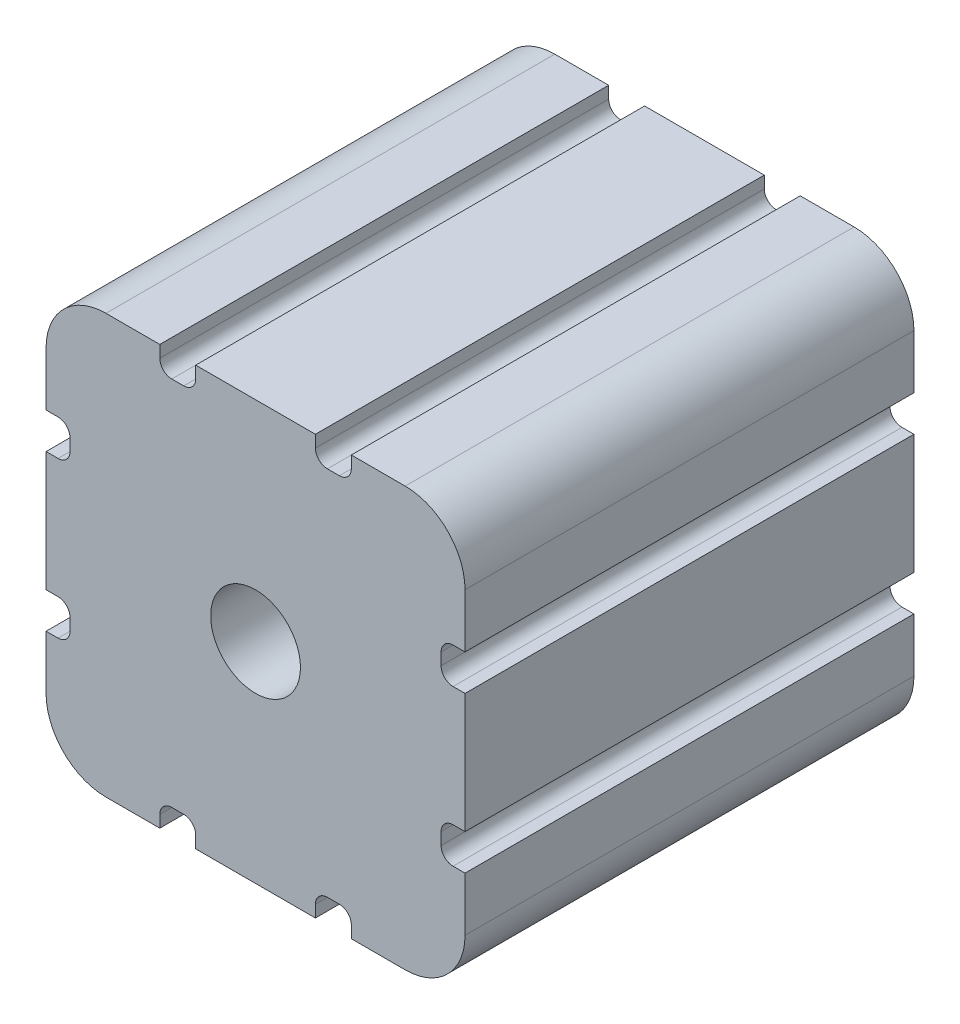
ISO-10303-21;
HEADER;
FILE_DESCRIPTION(('STEP AP214'),'2;1');
FILE_NAME('part.step','',(''),(''),'','','');
FILE_SCHEMA(('AUTOMOTIVE_DESIGN { 1 0 10303 214 1 1 1 1 }'));
ENDSEC;
DATA;
#1=APPLICATION_CONTEXT('core data for automotive mechanical design processes');
#2=APPLICATION_PROTOCOL_DEFINITION('international standard','automotive_design',2000,#1);
#3=PRODUCT_CONTEXT('',#1,'mechanical');
#4=PRODUCT('Part','Part','',(#3));
#5=PRODUCT_RELATED_PRODUCT_CATEGORY('part','',(#4));
#6=PRODUCT_DEFINITION_FORMATION('','',#4);
#7=PRODUCT_DEFINITION_CONTEXT('part definition',#1,'design');
#8=PRODUCT_DEFINITION('design','',#6,#7);
#9=PRODUCT_DEFINITION_SHAPE('','',#8);
#10=(LENGTH_UNIT() NAMED_UNIT(*) SI_UNIT(.MILLI.,.METRE.));
#11=(NAMED_UNIT(*) PLANE_ANGLE_UNIT() SI_UNIT($,.RADIAN.));
#12=(NAMED_UNIT(*) SI_UNIT($,.STERADIAN.) SOLID_ANGLE_UNIT());
#13=UNCERTAINTY_MEASURE_WITH_UNIT(LENGTH_MEASURE(1.E-05),#10,'distance_accuracy_value','');
#14=(GEOMETRIC_REPRESENTATION_CONTEXT(3) GLOBAL_UNCERTAINTY_ASSIGNED_CONTEXT((#13)) GLOBAL_UNIT_ASSIGNED_CONTEXT((#10,
#11,#12)) REPRESENTATION_CONTEXT('',''));
#15=CARTESIAN_POINT('',(0.,0.,0.));
#16=DIRECTION('',(0.,0.,1.));
#17=DIRECTION('',(1.,0.,0.));
#18=AXIS2_PLACEMENT_3D('',#15,#16,#17);
#19=CARTESIAN_POINT('',(70.,0.,75.));
#20=DIRECTION('',(-1.,0.,0.));
#21=DIRECTION('',(0.,0.,1.));
#22=AXIS2_PLACEMENT_3D('',#19,#20,#21);
#23=PLANE('',#22);
#24=DIRECTION('',(0.,1.,0.));
#25=VECTOR('',#24,1.);
#26=CARTESIAN_POINT('',(70.,0.,75.));
#27=LINE('',#26,#25);
#28=CARTESIAN_POINT('',(70.0000000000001,25.0000000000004,75.));
#29=VERTEX_POINT('',#28);
#30=CARTESIAN_POINT('',(69.9999999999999,45.0000000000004,75.));
#31=VERTEX_POINT('',#30);
#32=EDGE_CURVE('E765',#29,#31,#27,.T.);
#33=ORIENTED_EDGE('',*,*,#32,.F.);
#34=DIRECTION('',(0.,0.,1.));
#35=VECTOR('',#34,1.);
#36=CARTESIAN_POINT('',(70.0000000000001,25.0000000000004,0.));
#37=LINE('',#36,#35);
#38=CARTESIAN_POINT('',(70.0000000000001,25.0000000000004,0.));
#39=VERTEX_POINT('',#38);
#40=EDGE_CURVE('E421',#39,#29,#37,.T.);
#41=ORIENTED_EDGE('',*,*,#40,.F.);
#42=DIRECTION('',(0.,1.,0.));
#43=VECTOR('',#42,1.);
#44=CARTESIAN_POINT('',(70.,0.,0.));
#45=LINE('',#44,#43);
#46=CARTESIAN_POINT('',(69.9999999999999,45.0000000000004,0.));
#47=VERTEX_POINT('',#46);
#48=EDGE_CURVE('E745',#39,#47,#45,.T.);
#49=ORIENTED_EDGE('',*,*,#48,.T.);
#50=DIRECTION('',(0.,0.,1.));
#51=VECTOR('',#50,1.);
#52=CARTESIAN_POINT('',(69.9999999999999,45.0000000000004,0.));
#53=LINE('',#52,#51);
#54=EDGE_CURVE('E460',#47,#31,#53,.T.);
#55=ORIENTED_EDGE('',*,*,#54,.T.);
#56=EDGE_LOOP('',(#33,#41,#49,#55));
#57=FACE_BOUND('',#56,.T.);
#58=ADVANCED_FACE('F24',(#57),#23,.F.);
#59=CARTESIAN_POINT('',(69.9999999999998,51.0000000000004,75.));
#60=VERTEX_POINT('',#59);
#61=CARTESIAN_POINT('',(70.,60.,75.));
#62=VERTEX_POINT('',#61);
#63=EDGE_CURVE('E759',#60,#62,#27,.T.);
#64=ORIENTED_EDGE('',*,*,#63,.F.);
#65=DIRECTION('',(0.,0.,1.));
#66=VECTOR('',#65,1.);
#67=CARTESIAN_POINT('',(69.9999999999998,51.0000000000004,0.));
#68=LINE('',#67,#66);
#69=CARTESIAN_POINT('',(69.9999999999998,51.0000000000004,0.));
#70=VERTEX_POINT('',#69);
#71=EDGE_CURVE('E457',#70,#60,#68,.T.);
#72=ORIENTED_EDGE('',*,*,#71,.F.);
#73=CARTESIAN_POINT('',(70.,60.,0.));
#74=VERTEX_POINT('',#73);
#75=EDGE_CURVE('E739',#70,#74,#45,.T.);
#76=ORIENTED_EDGE('',*,*,#75,.T.);
#77=DIRECTION('',(0.,0.,-1.));
#78=VECTOR('',#77,1.);
#79=CARTESIAN_POINT('',(70.,60.,75.));
#80=LINE('',#79,#78);
#81=EDGE_CURVE('E791',#74,#62,#80,.F.);
#82=ORIENTED_EDGE('',*,*,#81,.T.);
#83=EDGE_LOOP('',(#64,#72,#76,#82));
#84=FACE_BOUND('',#83,.T.);
#85=ADVANCED_FACE('F844',(#84),#23,.F.);
#86=CARTESIAN_POINT('',(0.,0.,75.));
#87=DIRECTION('',(0.,1.,0.));
#88=DIRECTION('',(0.,0.,1.));
#89=AXIS2_PLACEMENT_3D('',#86,#87,#88);
#90=PLANE('',#89);
#91=DIRECTION('',(1.,0.,0.));
#92=VECTOR('',#91,1.);
#93=CARTESIAN_POINT('',(0.,0.,75.));
#94=LINE('',#93,#92);
#95=CARTESIAN_POINT('',(25.0000000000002,0.,75.));
#96=VERTEX_POINT('',#95);
#97=CARTESIAN_POINT('',(45.0000000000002,0.,75.));
#98=VERTEX_POINT('',#97);
#99=EDGE_CURVE('E760',#96,#98,#94,.T.);
#100=ORIENTED_EDGE('',*,*,#99,.F.);
#101=DIRECTION('',(0.,0.,1.));
#102=VECTOR('',#101,1.);
#103=CARTESIAN_POINT('',(25.0000000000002,0.,0.));
#104=LINE('',#103,#102);
#105=CARTESIAN_POINT('',(25.0000000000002,0.,0.));
#106=VERTEX_POINT('',#105);
#107=EDGE_CURVE('E502',#106,#96,#104,.T.);
#108=ORIENTED_EDGE('',*,*,#107,.F.);
#109=DIRECTION('',(1.,0.,0.));
#110=VECTOR('',#109,1.);
#111=CARTESIAN_POINT('',(0.,0.,0.));
#112=LINE('',#111,#110);
#113=CARTESIAN_POINT('',(45.0000000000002,0.,0.));
#114=VERTEX_POINT('',#113);
#115=EDGE_CURVE('E740',#106,#114,#112,.T.);
#116=ORIENTED_EDGE('',*,*,#115,.T.);
#117=DIRECTION('',(0.,0.,1.));
#118=VECTOR('',#117,1.);
#119=CARTESIAN_POINT('',(45.0000000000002,0.,0.));
#120=LINE('',#119,#118);
#121=EDGE_CURVE('E545',#114,#98,#120,.T.);
#122=ORIENTED_EDGE('',*,*,#121,.T.);
#123=EDGE_LOOP('',(#100,#108,#116,#122));
#124=FACE_BOUND('',#123,.T.);
#125=ADVANCED_FACE('F955',(#124),#90,.F.);
#126=CARTESIAN_POINT('',(51.0000000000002,1.11022302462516E-13,75.));
#127=VERTEX_POINT('',#126);
#128=CARTESIAN_POINT('',(60.,0.,75.));
#129=VERTEX_POINT('',#128);
#130=EDGE_CURVE('E754',#127,#129,#94,.T.);
#131=ORIENTED_EDGE('',*,*,#130,.F.);
#132=DIRECTION('',(0.,0.,1.));
#133=VECTOR('',#132,1.);
#134=CARTESIAN_POINT('',(51.0000000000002,1.11022302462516E-13,0.));
#135=LINE('',#134,#133);
#136=CARTESIAN_POINT('',(51.0000000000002,1.11022302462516E-13,0.));
#137=VERTEX_POINT('',#136);
#138=EDGE_CURVE('E542',#137,#127,#135,.T.);
#139=ORIENTED_EDGE('',*,*,#138,.F.);
#140=CARTESIAN_POINT('',(60.,0.,0.));
#141=VERTEX_POINT('',#140);
#142=EDGE_CURVE('E734',#137,#141,#112,.T.);
#143=ORIENTED_EDGE('',*,*,#142,.T.);
#144=DIRECTION('',(0.,0.,-1.));
#145=VECTOR('',#144,1.);
#146=CARTESIAN_POINT('',(60.,0.,75.));
#147=LINE('',#146,#145);
#148=EDGE_CURVE('E32',#141,#129,#147,.F.);
#149=ORIENTED_EDGE('',*,*,#148,.T.);
#150=EDGE_LOOP('',(#131,#139,#143,#149));
#151=FACE_BOUND('',#150,.T.);
#152=ADVANCED_FACE('F812',(#151),#90,.F.);
#153=CARTESIAN_POINT('',(0.,0.,75.));
#154=DIRECTION('',(1.,0.,0.));
#155=DIRECTION('',(0.,0.,-1.));
#156=AXIS2_PLACEMENT_3D('',#153,#154,#155);
#157=PLANE('',#156);
#158=DIRECTION('',(0.,-1.,0.));
#159=VECTOR('',#158,1.);
#160=CARTESIAN_POINT('',(0.,0.,75.));
#161=LINE('',#160,#159);
#162=CARTESIAN_POINT('',(0.,44.9999999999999,75.));
#163=VERTEX_POINT('',#162);
#164=CARTESIAN_POINT('',(0.,24.9999999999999,75.));
#165=VERTEX_POINT('',#164);
#166=EDGE_CURVE('E755',#163,#165,#161,.T.);
#167=ORIENTED_EDGE('',*,*,#166,.F.);
#168=DIRECTION('',(0.,0.,1.));
#169=VECTOR('',#168,1.);
#170=CARTESIAN_POINT('',(0.,44.9999999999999,0.));
#171=LINE('',#170,#169);
#172=CARTESIAN_POINT('',(0.,44.9999999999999,0.));
#173=VERTEX_POINT('',#172);
#174=EDGE_CURVE('E587',#173,#163,#171,.T.);
#175=ORIENTED_EDGE('',*,*,#174,.F.);
#176=DIRECTION('',(0.,-1.,0.));
#177=VECTOR('',#176,1.);
#178=CARTESIAN_POINT('',(0.,0.,0.));
#179=LINE('',#178,#177);
#180=CARTESIAN_POINT('',(0.,24.9999999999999,0.));
#181=VERTEX_POINT('',#180);
#182=EDGE_CURVE('E735',#173,#181,#179,.T.);
#183=ORIENTED_EDGE('',*,*,#182,.T.);
#184=DIRECTION('',(0.,0.,1.));
#185=VECTOR('',#184,1.);
#186=CARTESIAN_POINT('',(0.,24.9999999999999,0.));
#187=LINE('',#186,#185);
#188=EDGE_CURVE('E630',#181,#165,#187,.T.);
#189=ORIENTED_EDGE('',*,*,#188,.T.);
#190=EDGE_LOOP('',(#167,#175,#183,#189));
#191=FACE_BOUND('',#190,.T.);
#192=ADVANCED_FACE('F914',(#191),#157,.F.);
#193=CARTESIAN_POINT('',(0.,18.9999999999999,75.));
#194=VERTEX_POINT('',#193);
#195=CARTESIAN_POINT('',(0.,10.,75.));
#196=VERTEX_POINT('',#195);
#197=EDGE_CURVE('E749',#194,#196,#161,.T.);
#198=ORIENTED_EDGE('',*,*,#197,.F.);
#199=DIRECTION('',(0.,0.,1.));
#200=VECTOR('',#199,1.);
#201=CARTESIAN_POINT('',(0.,18.9999999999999,0.));
#202=LINE('',#201,#200);
#203=CARTESIAN_POINT('',(0.,18.9999999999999,0.));
#204=VERTEX_POINT('',#203);
#205=EDGE_CURVE('E627',#204,#194,#202,.T.);
#206=ORIENTED_EDGE('',*,*,#205,.F.);
#207=CARTESIAN_POINT('',(0.,10.,0.));
#208=VERTEX_POINT('',#207);
#209=EDGE_CURVE('E730',#204,#208,#179,.T.);
#210=ORIENTED_EDGE('',*,*,#209,.T.);
#211=DIRECTION('',(0.,0.,-1.));
#212=VECTOR('',#211,1.);
#213=CARTESIAN_POINT('',(0.,10.,75.));
#214=LINE('',#213,#212);
#215=EDGE_CURVE('E802',#208,#196,#214,.F.);
#216=ORIENTED_EDGE('',*,*,#215,.T.);
#217=EDGE_LOOP('',(#198,#206,#210,#216));
#218=FACE_BOUND('',#217,.T.);
#219=ADVANCED_FACE('F925',(#218),#157,.F.);
#220=CARTESIAN_POINT('',(0.,70.,75.));
#221=DIRECTION('',(0.,-1.,0.));
#222=DIRECTION('',(0.,0.,-1.));
#223=AXIS2_PLACEMENT_3D('',#220,#221,#222);
#224=PLANE('',#223);
#225=DIRECTION('',(-1.,0.,0.));
#226=VECTOR('',#225,1.);
#227=CARTESIAN_POINT('',(0.,70.,75.));
#228=LINE('',#227,#226);
#229=CARTESIAN_POINT('',(45.,70.,75.));
#230=VERTEX_POINT('',#229);
#231=CARTESIAN_POINT('',(25.,70.,75.));
#232=VERTEX_POINT('',#231);
#233=EDGE_CURVE('E770',#230,#232,#228,.T.);
#234=ORIENTED_EDGE('',*,*,#233,.F.);
#235=DIRECTION('',(0.,0.,1.));
#236=VECTOR('',#235,1.);
#237=CARTESIAN_POINT('',(45.,70.,0.));
#238=LINE('',#237,#236);
#239=CARTESIAN_POINT('',(45.,70.,0.));
#240=VERTEX_POINT('',#239);
#241=EDGE_CURVE('E672',#240,#230,#238,.T.);
#242=ORIENTED_EDGE('',*,*,#241,.F.);
#243=DIRECTION('',(-1.,0.,0.));
#244=VECTOR('',#243,1.);
#245=CARTESIAN_POINT('',(0.,70.,0.));
#246=LINE('',#245,#244);
#247=CARTESIAN_POINT('',(25.,70.,0.));
#248=VERTEX_POINT('',#247);
#249=EDGE_CURVE('E750',#240,#248,#246,.T.);
#250=ORIENTED_EDGE('',*,*,#249,.T.);
#251=DIRECTION('',(0.,0.,1.));
#252=VECTOR('',#251,1.);
#253=CARTESIAN_POINT('',(25.,70.,0.));
#254=LINE('',#253,#252);
#255=EDGE_CURVE('E715',#248,#232,#254,.T.);
#256=ORIENTED_EDGE('',*,*,#255,.T.);
#257=EDGE_LOOP('',(#234,#242,#250,#256));
#258=FACE_BOUND('',#257,.T.);
#259=ADVANCED_FACE('F874',(#258),#224,.F.);
#260=CARTESIAN_POINT('',(19.,70.,75.));
#261=VERTEX_POINT('',#260);
#262=CARTESIAN_POINT('',(10.,70.,75.));
#263=VERTEX_POINT('',#262);
#264=EDGE_CURVE('E764',#261,#263,#228,.T.);
#265=ORIENTED_EDGE('',*,*,#264,.F.);
#266=DIRECTION('',(0.,0.,1.));
#267=VECTOR('',#266,1.);
#268=CARTESIAN_POINT('',(19.,70.,0.));
#269=LINE('',#268,#267);
#270=CARTESIAN_POINT('',(19.,70.,0.));
#271=VERTEX_POINT('',#270);
#272=EDGE_CURVE('E712',#271,#261,#269,.T.);
#273=ORIENTED_EDGE('',*,*,#272,.F.);
#274=CARTESIAN_POINT('',(10.,70.,0.));
#275=VERTEX_POINT('',#274);
#276=EDGE_CURVE('E744',#271,#275,#246,.T.);
#277=ORIENTED_EDGE('',*,*,#276,.T.);
#278=DIRECTION('',(0.,0.,-1.));
#279=VECTOR('',#278,1.);
#280=CARTESIAN_POINT('',(10.,70.,75.));
#281=LINE('',#280,#279);
#282=EDGE_CURVE('E769',#275,#263,#281,.F.);
#283=ORIENTED_EDGE('',*,*,#282,.T.);
#284=EDGE_LOOP('',(#265,#273,#277,#283));
#285=FACE_BOUND('',#284,.T.);
#286=ADVANCED_FACE('F885',(#285),#224,.F.);
#287=CARTESIAN_POINT('',(0.,60.,0.));
#288=VERTEX_POINT('',#287);
#289=CARTESIAN_POINT('',(0.,50.9999999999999,0.));
#290=VERTEX_POINT('',#289);
#291=EDGE_CURVE('E731',#288,#290,#179,.T.);
#292=ORIENTED_EDGE('',*,*,#291,.T.);
#293=DIRECTION('',(0.,0.,1.));
#294=VECTOR('',#293,1.);
#295=CARTESIAN_POINT('',(0.,50.9999999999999,0.));
#296=LINE('',#295,#294);
#297=CARTESIAN_POINT('',(0.,50.9999999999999,75.));
#298=VERTEX_POINT('',#297);
#299=EDGE_CURVE('E589',#290,#298,#296,.T.);
#300=ORIENTED_EDGE('',*,*,#299,.T.);
#301=CARTESIAN_POINT('',(0.,60.,75.));
#302=VERTEX_POINT('',#301);
#303=EDGE_CURVE('E751',#302,#298,#161,.T.);
#304=ORIENTED_EDGE('',*,*,#303,.F.);
#305=DIRECTION('',(0.,0.,-1.));
#306=VECTOR('',#305,1.);
#307=CARTESIAN_POINT('',(0.,60.,75.));
#308=LINE('',#307,#306);
#309=EDGE_CURVE('E805',#302,#288,#308,.T.);
#310=ORIENTED_EDGE('',*,*,#309,.T.);
#311=EDGE_LOOP('',(#292,#300,#304,#310));
#312=FACE_BOUND('',#311,.T.);
#313=ADVANCED_FACE('F26',(#312),#157,.F.);
#314=CARTESIAN_POINT('',(10.,0.,0.));
#315=VERTEX_POINT('',#314);
#316=CARTESIAN_POINT('',(19.0000000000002,-1.11022302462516E-13,0.));
#317=VERTEX_POINT('',#316);
#318=EDGE_CURVE('E736',#315,#317,#112,.T.);
#319=ORIENTED_EDGE('',*,*,#318,.T.);
#320=DIRECTION('',(0.,0.,1.));
#321=VECTOR('',#320,1.);
#322=CARTESIAN_POINT('',(19.0000000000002,-1.11022302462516E-13,0.));
#323=LINE('',#322,#321);
#324=CARTESIAN_POINT('',(19.0000000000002,-1.11022302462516E-13,75.));
#325=VERTEX_POINT('',#324);
#326=EDGE_CURVE('E504',#317,#325,#323,.T.);
#327=ORIENTED_EDGE('',*,*,#326,.T.);
#328=CARTESIAN_POINT('',(10.,0.,75.));
#329=VERTEX_POINT('',#328);
#330=EDGE_CURVE('E756',#329,#325,#94,.T.);
#331=ORIENTED_EDGE('',*,*,#330,.F.);
#332=DIRECTION('',(0.,0.,-1.));
#333=VECTOR('',#332,1.);
#334=CARTESIAN_POINT('',(10.,0.,75.));
#335=LINE('',#334,#333);
#336=EDGE_CURVE('E11',#329,#315,#335,.T.);
#337=ORIENTED_EDGE('',*,*,#336,.T.);
#338=EDGE_LOOP('',(#319,#327,#331,#337));
#339=FACE_BOUND('',#338,.T.);
#340=ADVANCED_FACE('F932',(#339),#90,.F.);
#341=CARTESIAN_POINT('',(70.,10.,0.));
#342=VERTEX_POINT('',#341);
#343=CARTESIAN_POINT('',(70.0000000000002,19.0000000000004,0.));
#344=VERTEX_POINT('',#343);
#345=EDGE_CURVE('E741',#342,#344,#45,.T.);
#346=ORIENTED_EDGE('',*,*,#345,.T.);
#347=DIRECTION('',(0.,0.,1.));
#348=VECTOR('',#347,1.);
#349=CARTESIAN_POINT('',(70.0000000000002,19.0000000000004,0.));
#350=LINE('',#349,#348);
#351=CARTESIAN_POINT('',(70.0000000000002,19.0000000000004,75.));
#352=VERTEX_POINT('',#351);
#353=EDGE_CURVE('E423',#344,#352,#350,.T.);
#354=ORIENTED_EDGE('',*,*,#353,.T.);
#355=CARTESIAN_POINT('',(70.,10.,75.));
#356=VERTEX_POINT('',#355);
#357=EDGE_CURVE('E761',#356,#352,#27,.T.);
#358=ORIENTED_EDGE('',*,*,#357,.F.);
#359=DIRECTION('',(0.,0.,-1.));
#360=VECTOR('',#359,1.);
#361=CARTESIAN_POINT('',(70.,10.,75.));
#362=LINE('',#361,#360);
#363=EDGE_CURVE('E788',#356,#342,#362,.T.);
#364=ORIENTED_EDGE('',*,*,#363,.T.);
#365=EDGE_LOOP('',(#346,#354,#358,#364));
#366=FACE_BOUND('',#365,.T.);
#367=ADVANCED_FACE('F821',(#366),#23,.F.);
#368=CARTESIAN_POINT('',(60.,70.,0.));
#369=VERTEX_POINT('',#368);
#370=CARTESIAN_POINT('',(51.,70.,0.));
#371=VERTEX_POINT('',#370);
#372=EDGE_CURVE('E746',#369,#371,#246,.T.);
#373=ORIENTED_EDGE('',*,*,#372,.T.);
#374=DIRECTION('',(0.,0.,1.));
#375=VECTOR('',#374,1.);
#376=CARTESIAN_POINT('',(51.,70.,0.));
#377=LINE('',#376,#375);
#378=CARTESIAN_POINT('',(51.,70.,75.));
#379=VERTEX_POINT('',#378);
#380=EDGE_CURVE('E674',#371,#379,#377,.T.);
#381=ORIENTED_EDGE('',*,*,#380,.T.);
#382=CARTESIAN_POINT('',(60.,70.,75.));
#383=VERTEX_POINT('',#382);
#384=EDGE_CURVE('E766',#383,#379,#228,.T.);
#385=ORIENTED_EDGE('',*,*,#384,.F.);
#386=DIRECTION('',(0.,0.,-1.));
#387=VECTOR('',#386,1.);
#388=CARTESIAN_POINT('',(60.,70.,75.));
#389=LINE('',#388,#387);
#390=EDGE_CURVE('E773',#383,#369,#389,.T.);
#391=ORIENTED_EDGE('',*,*,#390,.T.);
#392=EDGE_LOOP('',(#373,#381,#385,#391));
#393=FACE_BOUND('',#392,.T.);
#394=ADVANCED_FACE('F851',(#393),#224,.F.);
#395=CARTESIAN_POINT('',(0.,70.,75.));
#396=DIRECTION('',(0.,0.,-1.));
#397=DIRECTION('',(-1.,0.,0.));
#398=AXIS2_PLACEMENT_3D('',#395,#396,#397);
#399=PLANE('',#398);
#400=CARTESIAN_POINT('',(35.,35.,75.));
#401=DIRECTION('',(0.,0.,1.));
#402=DIRECTION('',(1.,0.,0.));
#403=AXIS2_PLACEMENT_3D('',#400,#401,#402);
#404=CIRCLE('',#403,7.5);
#405=CARTESIAN_POINT('',(42.5,35.,75.));
#406=VERTEX_POINT('',#405);
#407=EDGE_CURVE('E714',#406,#406,#404,.T.);
#408=ORIENTED_EDGE('',*,*,#407,.F.);
#409=EDGE_LOOP('',(#408));
#410=FACE_BOUND('',#409,.T.);
#411=CARTESIAN_POINT('',(68.0000000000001,23.0000000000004,75.));
#412=DIRECTION('',(0.,0.,1.));
#413=DIRECTION('',(0.,-1.,0.));
#414=AXIS2_PLACEMENT_3D('',#411,#412,#413);
#415=CIRCLE('',#414,2.);
#416=CARTESIAN_POINT('',(68.0000000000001,25.0000000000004,75.));
#417=VERTEX_POINT('',#416);
#418=CARTESIAN_POINT('',(66.0000000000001,23.0000000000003,75.));
#419=VERTEX_POINT('',#418);
#420=EDGE_CURVE('E392',#417,#419,#415,.T.);
#421=ORIENTED_EDGE('',*,*,#420,.F.);
#422=DIRECTION('',(-1.,0.,0.));
#423=VECTOR('',#422,1.);
#424=CARTESIAN_POINT('',(70.0000000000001,25.0000000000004,75.));
#425=LINE('',#424,#423);
#426=EDGE_CURVE('E408',#29,#417,#425,.T.);
#427=ORIENTED_EDGE('',*,*,#426,.F.);
#428=ORIENTED_EDGE('',*,*,#32,.T.);
#429=DIRECTION('',(1.,0.,0.));
#430=VECTOR('',#429,1.);
#431=CARTESIAN_POINT('',(69.9999999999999,45.0000000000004,75.));
#432=LINE('',#431,#430);
#433=CARTESIAN_POINT('',(67.9999999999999,45.0000000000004,75.));
#434=VERTEX_POINT('',#433);
#435=EDGE_CURVE('E440',#434,#31,#432,.T.);
#436=ORIENTED_EDGE('',*,*,#435,.F.);
#437=CARTESIAN_POINT('',(67.9999999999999,47.0000000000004,75.));
#438=DIRECTION('',(0.,0.,1.));
#439=DIRECTION('',(0.,1.,0.));
#440=AXIS2_PLACEMENT_3D('',#437,#438,#439);
#441=CIRCLE('',#440,2.);
#442=CARTESIAN_POINT('',(65.9999999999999,47.0000000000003,75.));
#443=VERTEX_POINT('',#442);
#444=EDGE_CURVE('E437',#443,#434,#441,.T.);
#445=ORIENTED_EDGE('',*,*,#444,.F.);
#446=DIRECTION('',(0.,-1.,0.));
#447=VECTOR('',#446,1.);
#448=CARTESIAN_POINT('',(65.9999999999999,49.0000000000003,75.));
#449=LINE('',#448,#447);
#450=CARTESIAN_POINT('',(65.9999999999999,49.0000000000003,75.));
#451=VERTEX_POINT('',#450);
#452=EDGE_CURVE('E434',#451,#443,#449,.T.);
#453=ORIENTED_EDGE('',*,*,#452,.F.);
#454=CARTESIAN_POINT('',(67.9999999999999,49.0000000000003,75.));
#455=DIRECTION('',(0.,0.,1.));
#456=DIRECTION('',(0.,-1.,0.));
#457=AXIS2_PLACEMENT_3D('',#454,#455,#456);
#458=CIRCLE('',#457,2.);
#459=CARTESIAN_POINT('',(67.9999999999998,51.0000000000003,75.));
#460=VERTEX_POINT('',#459);
#461=EDGE_CURVE('E431',#460,#451,#458,.T.);
#462=ORIENTED_EDGE('',*,*,#461,.F.);
#463=DIRECTION('',(-1.,0.,0.));
#464=VECTOR('',#463,1.);
#465=CARTESIAN_POINT('',(69.9999999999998,51.0000000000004,75.));
#466=LINE('',#465,#464);
#467=EDGE_CURVE('E420',#60,#460,#466,.T.);
#468=ORIENTED_EDGE('',*,*,#467,.F.);
#469=ORIENTED_EDGE('',*,*,#63,.T.);
#470=CARTESIAN_POINT('',(60.,60.,75.));
#471=DIRECTION('',(0.,0.,-1.));
#472=DIRECTION('',(-1.,0.,0.));
#473=AXIS2_PLACEMENT_3D('',#470,#471,#472);
#474=CIRCLE('',#473,10.);
#475=EDGE_CURVE('E800',#62,#383,#474,.F.);
#476=ORIENTED_EDGE('',*,*,#475,.T.);
#477=ORIENTED_EDGE('',*,*,#384,.T.);
#478=DIRECTION('',(0.,1.,0.));
#479=VECTOR('',#478,1.);
#480=CARTESIAN_POINT('',(51.,70.,75.));
#481=LINE('',#480,#479);
#482=CARTESIAN_POINT('',(51.,68.,75.));
#483=VERTEX_POINT('',#482);
#484=EDGE_CURVE('E648',#483,#379,#481,.T.);
#485=ORIENTED_EDGE('',*,*,#484,.F.);
#486=CARTESIAN_POINT('',(49.,68.,75.));
#487=DIRECTION('',(0.,0.,1.));
#488=DIRECTION('',(-1.,0.,0.));
#489=AXIS2_PLACEMENT_3D('',#486,#487,#488);
#490=CIRCLE('',#489,2.);
#491=CARTESIAN_POINT('',(49.,66.,75.));
#492=VERTEX_POINT('',#491);
#493=EDGE_CURVE('E645',#492,#483,#490,.T.);
#494=ORIENTED_EDGE('',*,*,#493,.F.);
#495=DIRECTION('',(1.,0.,0.));
#496=VECTOR('',#495,1.);
#497=CARTESIAN_POINT('',(49.,66.,75.));
#498=LINE('',#497,#496);
#499=CARTESIAN_POINT('',(47.,66.,75.));
#500=VERTEX_POINT('',#499);
#501=EDGE_CURVE('E642',#500,#492,#498,.T.);
#502=ORIENTED_EDGE('',*,*,#501,.F.);
#503=CARTESIAN_POINT('',(47.,68.,75.));
#504=DIRECTION('',(0.,0.,1.));
#505=DIRECTION('',(1.,0.,0.));
#506=AXIS2_PLACEMENT_3D('',#503,#504,#505);
#507=CIRCLE('',#506,2.);
#508=CARTESIAN_POINT('',(45.,68.,75.));
#509=VERTEX_POINT('',#508);
#510=EDGE_CURVE('E629',#509,#500,#507,.T.);
#511=ORIENTED_EDGE('',*,*,#510,.F.);
#512=DIRECTION('',(0.,-1.,0.));
#513=VECTOR('',#512,1.);
#514=CARTESIAN_POINT('',(45.,70.,75.));
#515=LINE('',#514,#513);
#516=EDGE_CURVE('E650',#230,#509,#515,.T.);
#517=ORIENTED_EDGE('',*,*,#516,.F.);
#518=ORIENTED_EDGE('',*,*,#233,.T.);
#519=DIRECTION('',(0.,1.,0.));
#520=VECTOR('',#519,1.);
#521=CARTESIAN_POINT('',(25.,70.,75.));
#522=LINE('',#521,#520);
#523=CARTESIAN_POINT('',(25.,68.,75.));
#524=VERTEX_POINT('',#523);
#525=EDGE_CURVE('E693',#524,#232,#522,.T.);
#526=ORIENTED_EDGE('',*,*,#525,.F.);
#527=CARTESIAN_POINT('',(23.,68.,75.));
#528=DIRECTION('',(0.,0.,1.));
#529=DIRECTION('',(-1.,0.,0.));
#530=AXIS2_PLACEMENT_3D('',#527,#528,#529);
#531=CIRCLE('',#530,2.);
#532=CARTESIAN_POINT('',(23.,66.,75.));
#533=VERTEX_POINT('',#532);
#534=EDGE_CURVE('E690',#533,#524,#531,.T.);
#535=ORIENTED_EDGE('',*,*,#534,.F.);
#536=DIRECTION('',(1.,0.,0.));
#537=VECTOR('',#536,1.);
#538=CARTESIAN_POINT('',(21.,66.,75.));
#539=LINE('',#538,#537);
#540=CARTESIAN_POINT('',(21.,66.,75.));
#541=VERTEX_POINT('',#540);
#542=EDGE_CURVE('E687',#541,#533,#539,.T.);
#543=ORIENTED_EDGE('',*,*,#542,.F.);
#544=CARTESIAN_POINT('',(21.,68.,75.));
#545=DIRECTION('',(0.,0.,1.));
#546=DIRECTION('',(1.,0.,0.));
#547=AXIS2_PLACEMENT_3D('',#544,#545,#546);
#548=CIRCLE('',#547,2.);
#549=CARTESIAN_POINT('',(19.,68.,75.));
#550=VERTEX_POINT('',#549);
#551=EDGE_CURVE('E684',#550,#541,#548,.T.);
#552=ORIENTED_EDGE('',*,*,#551,.F.);
#553=DIRECTION('',(0.,-1.,0.));
#554=VECTOR('',#553,1.);
#555=CARTESIAN_POINT('',(19.,70.,75.));
#556=LINE('',#555,#554);
#557=EDGE_CURVE('E671',#261,#550,#556,.T.);
#558=ORIENTED_EDGE('',*,*,#557,.F.);
#559=ORIENTED_EDGE('',*,*,#264,.T.);
#560=CARTESIAN_POINT('',(10.,60.,75.));
#561=DIRECTION('',(0.,0.,-1.));
#562=DIRECTION('',(-1.,0.,0.));
#563=AXIS2_PLACEMENT_3D('',#560,#561,#562);
#564=CIRCLE('',#563,10.);
#565=EDGE_CURVE('E798',#263,#302,#564,.F.);
#566=ORIENTED_EDGE('',*,*,#565,.T.);
#567=ORIENTED_EDGE('',*,*,#303,.T.);
#568=DIRECTION('',(-1.,0.,0.));
#569=VECTOR('',#568,1.);
#570=CARTESIAN_POINT('',(0.,50.9999999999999,75.));
#571=LINE('',#570,#569);
#572=CARTESIAN_POINT('',(1.99999999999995,50.9999999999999,75.));
#573=VERTEX_POINT('',#572);
#574=EDGE_CURVE('E563',#573,#298,#571,.T.);
#575=ORIENTED_EDGE('',*,*,#574,.F.);
#576=CARTESIAN_POINT('',(1.99999999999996,48.9999999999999,75.));
#577=DIRECTION('',(0.,0.,1.));
#578=DIRECTION('',(0.,-1.,0.));
#579=AXIS2_PLACEMENT_3D('',#576,#577,#578);
#580=CIRCLE('',#579,2.);
#581=CARTESIAN_POINT('',(3.99999999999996,48.9999999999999,75.));
#582=VERTEX_POINT('',#581);
#583=EDGE_CURVE('E560',#582,#573,#580,.T.);
#584=ORIENTED_EDGE('',*,*,#583,.F.);
#585=DIRECTION('',(0.,1.,0.));
#586=VECTOR('',#585,1.);
#587=CARTESIAN_POINT('',(3.99999999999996,48.9999999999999,75.));
#588=LINE('',#587,#586);
#589=CARTESIAN_POINT('',(3.99999999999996,46.9999999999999,75.));
#590=VERTEX_POINT('',#589);
#591=EDGE_CURVE('E557',#590,#582,#588,.T.);
#592=ORIENTED_EDGE('',*,*,#591,.F.);
#593=CARTESIAN_POINT('',(1.99999999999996,46.9999999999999,75.));
#594=DIRECTION('',(0.,0.,1.));
#595=DIRECTION('',(0.,1.,0.));
#596=AXIS2_PLACEMENT_3D('',#593,#594,#595);
#597=CIRCLE('',#596,2.);
#598=CARTESIAN_POINT('',(1.99999999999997,44.9999999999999,75.));
#599=VERTEX_POINT('',#598);
#600=EDGE_CURVE('E544',#599,#590,#597,.T.);
#601=ORIENTED_EDGE('',*,*,#600,.F.);
#602=DIRECTION('',(1.,0.,0.));
#603=VECTOR('',#602,1.);
#604=CARTESIAN_POINT('',(0.,44.9999999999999,75.));
#605=LINE('',#604,#603);
#606=EDGE_CURVE('E565',#163,#599,#605,.T.);
#607=ORIENTED_EDGE('',*,*,#606,.F.);
#608=ORIENTED_EDGE('',*,*,#166,.T.);
#609=DIRECTION('',(-1.,0.,0.));
#610=VECTOR('',#609,1.);
#611=CARTESIAN_POINT('',(0.,24.9999999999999,75.));
#612=LINE('',#611,#610);
#613=CARTESIAN_POINT('',(2.00000000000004,24.9999999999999,75.));
#614=VERTEX_POINT('',#613);
#615=EDGE_CURVE('E608',#614,#165,#612,.T.);
#616=ORIENTED_EDGE('',*,*,#615,.F.);
#617=CARTESIAN_POINT('',(2.00000000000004,22.9999999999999,75.));
#618=DIRECTION('',(0.,0.,1.));
#619=DIRECTION('',(0.,-1.,0.));
#620=AXIS2_PLACEMENT_3D('',#617,#618,#619);
#621=CIRCLE('',#620,2.);
#622=CARTESIAN_POINT('',(4.00000000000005,22.9999999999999,75.));
#623=VERTEX_POINT('',#622);
#624=EDGE_CURVE('E605',#623,#614,#621,.T.);
#625=ORIENTED_EDGE('',*,*,#624,.F.);
#626=DIRECTION('',(0.,1.,0.));
#627=VECTOR('',#626,1.);
#628=CARTESIAN_POINT('',(4.00000000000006,20.9999999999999,75.));
#629=LINE('',#628,#627);
#630=CARTESIAN_POINT('',(4.00000000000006,20.9999999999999,75.));
#631=VERTEX_POINT('',#630);
#632=EDGE_CURVE('E602',#631,#623,#629,.T.);
#633=ORIENTED_EDGE('',*,*,#632,.F.);
#634=CARTESIAN_POINT('',(2.00000000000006,20.9999999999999,75.));
#635=DIRECTION('',(0.,0.,1.));
#636=DIRECTION('',(0.,1.,0.));
#637=AXIS2_PLACEMENT_3D('',#634,#635,#636);
#638=CIRCLE('',#637,2.);
#639=CARTESIAN_POINT('',(2.00000000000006,18.9999999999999,75.));
#640=VERTEX_POINT('',#639);
#641=EDGE_CURVE('E599',#640,#631,#638,.T.);
#642=ORIENTED_EDGE('',*,*,#641,.F.);
#643=DIRECTION('',(1.,0.,0.));
#644=VECTOR('',#643,1.);
#645=CARTESIAN_POINT('',(0.,18.9999999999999,75.));
#646=LINE('',#645,#644);
#647=EDGE_CURVE('E586',#194,#640,#646,.T.);
#648=ORIENTED_EDGE('',*,*,#647,.F.);
#649=ORIENTED_EDGE('',*,*,#197,.T.);
#650=CARTESIAN_POINT('',(10.,10.,75.));
#651=DIRECTION('',(0.,0.,-1.));
#652=DIRECTION('',(-1.,0.,0.));
#653=AXIS2_PLACEMENT_3D('',#650,#651,#652);
#654=CIRCLE('',#653,10.);
#655=EDGE_CURVE('E796',#196,#329,#654,.F.);
#656=ORIENTED_EDGE('',*,*,#655,.T.);
#657=ORIENTED_EDGE('',*,*,#330,.T.);
#658=DIRECTION('',(0.,-1.,0.));
#659=VECTOR('',#658,1.);
#660=CARTESIAN_POINT('',(19.0000000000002,-1.11022302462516E-13,75.));
#661=LINE('',#660,#659);
#662=CARTESIAN_POINT('',(19.0000000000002,1.99999999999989,75.));
#663=VERTEX_POINT('',#662);
#664=EDGE_CURVE('E478',#663,#325,#661,.T.);
#665=ORIENTED_EDGE('',*,*,#664,.F.);
#666=CARTESIAN_POINT('',(21.0000000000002,1.9999999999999,75.));
#667=DIRECTION('',(0.,0.,1.));
#668=DIRECTION('',(1.,0.,0.));
#669=AXIS2_PLACEMENT_3D('',#666,#667,#668);
#670=CIRCLE('',#669,2.);
#671=CARTESIAN_POINT('',(21.0000000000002,3.99999999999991,75.));
#672=VERTEX_POINT('',#671);
#673=EDGE_CURVE('E475',#672,#663,#670,.T.);
#674=ORIENTED_EDGE('',*,*,#673,.F.);
#675=DIRECTION('',(-1.,0.,0.));
#676=VECTOR('',#675,1.);
#677=CARTESIAN_POINT('',(21.0000000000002,3.99999999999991,75.));
#678=LINE('',#677,#676);
#679=CARTESIAN_POINT('',(23.0000000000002,3.99999999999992,75.));
#680=VERTEX_POINT('',#679);
#681=EDGE_CURVE('E472',#680,#672,#678,.T.);
#682=ORIENTED_EDGE('',*,*,#681,.F.);
#683=CARTESIAN_POINT('',(23.0000000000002,1.99999999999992,75.));
#684=DIRECTION('',(0.,0.,1.));
#685=DIRECTION('',(-1.,0.,0.));
#686=AXIS2_PLACEMENT_3D('',#683,#684,#685);
#687=CIRCLE('',#686,2.);
#688=CARTESIAN_POINT('',(25.0000000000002,1.99999999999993,75.));
#689=VERTEX_POINT('',#688);
#690=EDGE_CURVE('E459',#689,#680,#687,.T.);
#691=ORIENTED_EDGE('',*,*,#690,.F.);
#692=DIRECTION('',(0.,1.,0.));
#693=VECTOR('',#692,1.);
#694=CARTESIAN_POINT('',(25.0000000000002,0.,75.));
#695=LINE('',#694,#693);
#696=EDGE_CURVE('E480',#96,#689,#695,.T.);
#697=ORIENTED_EDGE('',*,*,#696,.F.);
#698=ORIENTED_EDGE('',*,*,#99,.T.);
#699=DIRECTION('',(0.,-1.,0.));
#700=VECTOR('',#699,1.);
#701=CARTESIAN_POINT('',(45.0000000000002,0.,75.));
#702=LINE('',#701,#700);
#703=CARTESIAN_POINT('',(45.0000000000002,2.00000000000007,75.));
#704=VERTEX_POINT('',#703);
#705=EDGE_CURVE('E523',#704,#98,#702,.T.);
#706=ORIENTED_EDGE('',*,*,#705,.F.);
#707=CARTESIAN_POINT('',(47.0000000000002,2.00000000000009,75.));
#708=DIRECTION('',(0.,0.,1.));
#709=DIRECTION('',(1.,0.,0.));
#710=AXIS2_PLACEMENT_3D('',#707,#708,#709);
#711=CIRCLE('',#710,2.);
#712=CARTESIAN_POINT('',(47.0000000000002,4.00000000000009,75.));
#713=VERTEX_POINT('',#712);
#714=EDGE_CURVE('E520',#713,#704,#711,.T.);
#715=ORIENTED_EDGE('',*,*,#714,.F.);
#716=DIRECTION('',(-1.,0.,0.));
#717=VECTOR('',#716,1.);
#718=CARTESIAN_POINT('',(49.0000000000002,4.0000000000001,75.));
#719=LINE('',#718,#717);
#720=CARTESIAN_POINT('',(49.0000000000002,4.0000000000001,75.));
#721=VERTEX_POINT('',#720);
#722=EDGE_CURVE('E517',#721,#713,#719,.T.);
#723=ORIENTED_EDGE('',*,*,#722,.F.);
#724=CARTESIAN_POINT('',(49.0000000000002,2.0000000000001,75.));
#725=DIRECTION('',(0.,0.,1.));
#726=DIRECTION('',(-1.,0.,0.));
#727=AXIS2_PLACEMENT_3D('',#724,#725,#726);
#728=CIRCLE('',#727,2.);
#729=CARTESIAN_POINT('',(51.0000000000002,2.00000000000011,75.));
#730=VERTEX_POINT('',#729);
#731=EDGE_CURVE('E514',#730,#721,#728,.T.);
#732=ORIENTED_EDGE('',*,*,#731,.F.);
#733=DIRECTION('',(0.,1.,0.));
#734=VECTOR('',#733,1.);
#735=CARTESIAN_POINT('',(51.0000000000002,1.11022302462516E-13,75.));
#736=LINE('',#735,#734);
#737=EDGE_CURVE('E501',#127,#730,#736,.T.);
#738=ORIENTED_EDGE('',*,*,#737,.F.);
#739=ORIENTED_EDGE('',*,*,#130,.T.);
#740=CARTESIAN_POINT('',(60.,10.,75.));
#741=DIRECTION('',(0.,0.,-1.));
#742=DIRECTION('',(-1.,0.,0.));
#743=AXIS2_PLACEMENT_3D('',#740,#741,#742);
#744=CIRCLE('',#743,10.);
#745=EDGE_CURVE('E794',#129,#356,#744,.F.);
#746=ORIENTED_EDGE('',*,*,#745,.T.);
#747=ORIENTED_EDGE('',*,*,#357,.T.);
#748=DIRECTION('',(1.,0.,0.));
#749=VECTOR('',#748,1.);
#750=CARTESIAN_POINT('',(70.0000000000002,19.0000000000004,75.));
#751=LINE('',#750,#749);
#752=CARTESIAN_POINT('',(68.0000000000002,19.0000000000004,75.));
#753=VERTEX_POINT('',#752);
#754=EDGE_CURVE('E404',#753,#352,#751,.T.);
#755=ORIENTED_EDGE('',*,*,#754,.F.);
#756=CARTESIAN_POINT('',(68.0000000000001,21.0000000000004,75.));
#757=DIRECTION('',(0.,0.,1.));
#758=DIRECTION('',(0.,1.,0.));
#759=AXIS2_PLACEMENT_3D('',#756,#757,#758);
#760=CIRCLE('',#759,2.);
#761=CARTESIAN_POINT('',(66.0000000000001,21.0000000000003,75.));
#762=VERTEX_POINT('',#761);
#763=EDGE_CURVE('E402',#762,#753,#760,.T.);
#764=ORIENTED_EDGE('',*,*,#763,.F.);
#765=DIRECTION('',(0.,-1.,0.));
#766=VECTOR('',#765,1.);
#767=CARTESIAN_POINT('',(66.0000000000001,21.0000000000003,75.));
#768=LINE('',#767,#766);
#769=EDGE_CURVE('E381',#419,#762,#768,.T.);
#770=ORIENTED_EDGE('',*,*,#769,.F.);
#771=EDGE_LOOP('',(#421,#427,#428,#436,#445,#453,#462,#468,#469,#476,#477,#485,#494,#502,#511,
#517,#518,#526,#535,#543,#552,#558,#559,#566,#567,#575,#584,#592,#601,#607,#608,#616,#625,#633,
#642,#648,#649,#656,#657,#665,#674,#682,#691,#697,#698,#706,#715,#723,#732,#738,#739,#746,#747,
#755,#764,#770));
#772=FACE_BOUND('',#771,.T.);
#773=ADVANCED_FACE('F399',(#410,#772),#399,.F.);
#774=CARTESIAN_POINT('',(0.,70.,0.));
#775=DIRECTION('',(0.,0.,-1.));
#776=DIRECTION('',(-1.,0.,0.));
#777=AXIS2_PLACEMENT_3D('',#774,#775,#776);
#778=PLANE('',#777);
#779=DIRECTION('',(-1.,0.,0.));
#780=VECTOR('',#779,1.);
#781=CARTESIAN_POINT('',(70.0000000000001,25.0000000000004,0.));
#782=LINE('',#781,#780);
#783=CARTESIAN_POINT('',(68.0000000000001,25.0000000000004,0.));
#784=VERTEX_POINT('',#783);
#785=EDGE_CURVE('E389',#39,#784,#782,.T.);
#786=ORIENTED_EDGE('',*,*,#785,.T.);
#787=CARTESIAN_POINT('',(68.0000000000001,23.0000000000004,0.));
#788=DIRECTION('',(0.,0.,1.));
#789=DIRECTION('',(0.,-1.,0.));
#790=AXIS2_PLACEMENT_3D('',#787,#788,#789);
#791=CIRCLE('',#790,2.);
#792=CARTESIAN_POINT('',(66.0000000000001,23.0000000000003,0.));
#793=VERTEX_POINT('',#792);
#794=EDGE_CURVE('E410',#784,#793,#791,.T.);
#795=ORIENTED_EDGE('',*,*,#794,.T.);
#796=DIRECTION('',(0.,-1.,0.));
#797=VECTOR('',#796,1.);
#798=CARTESIAN_POINT('',(66.0000000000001,21.0000000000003,0.));
#799=LINE('',#798,#797);
#800=CARTESIAN_POINT('',(66.0000000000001,21.0000000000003,0.));
#801=VERTEX_POINT('',#800);
#802=EDGE_CURVE('E384',#793,#801,#799,.T.);
#803=ORIENTED_EDGE('',*,*,#802,.T.);
#804=CARTESIAN_POINT('',(68.0000000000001,21.0000000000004,0.));
#805=DIRECTION('',(0.,0.,1.));
#806=DIRECTION('',(0.,1.,0.));
#807=AXIS2_PLACEMENT_3D('',#804,#805,#806);
#808=CIRCLE('',#807,2.);
#809=CARTESIAN_POINT('',(68.0000000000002,19.0000000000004,0.));
#810=VERTEX_POINT('',#809);
#811=EDGE_CURVE('E39',#801,#810,#808,.T.);
#812=ORIENTED_EDGE('',*,*,#811,.T.);
#813=DIRECTION('',(1.,0.,0.));
#814=VECTOR('',#813,1.);
#815=CARTESIAN_POINT('',(70.0000000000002,19.0000000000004,0.));
#816=LINE('',#815,#814);
#817=EDGE_CURVE('E414',#810,#344,#816,.T.);
#818=ORIENTED_EDGE('',*,*,#817,.T.);
#819=ORIENTED_EDGE('',*,*,#345,.F.);
#820=CARTESIAN_POINT('',(60.,10.,0.));
#821=DIRECTION('',(0.,0.,-1.));
#822=DIRECTION('',(-1.,0.,0.));
#823=AXIS2_PLACEMENT_3D('',#820,#821,#822);
#824=CIRCLE('',#823,10.);
#825=EDGE_CURVE('E776',#342,#141,#824,.T.);
#826=ORIENTED_EDGE('',*,*,#825,.T.);
#827=ORIENTED_EDGE('',*,*,#142,.F.);
#828=DIRECTION('',(0.,1.,0.));
#829=VECTOR('',#828,1.);
#830=CARTESIAN_POINT('',(51.0000000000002,1.11022302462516E-13,0.));
#831=LINE('',#830,#829);
#832=CARTESIAN_POINT('',(51.0000000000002,2.00000000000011,0.));
#833=VERTEX_POINT('',#832);
#834=EDGE_CURVE('E526',#137,#833,#831,.T.);
#835=ORIENTED_EDGE('',*,*,#834,.T.);
#836=CARTESIAN_POINT('',(49.0000000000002,2.0000000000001,0.));
#837=DIRECTION('',(0.,0.,1.));
#838=DIRECTION('',(-1.,0.,0.));
#839=AXIS2_PLACEMENT_3D('',#836,#837,#838);
#840=CIRCLE('',#839,2.);
#841=CARTESIAN_POINT('',(49.0000000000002,4.0000000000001,0.));
#842=VERTEX_POINT('',#841);
#843=EDGE_CURVE('E529',#833,#842,#840,.T.);
#844=ORIENTED_EDGE('',*,*,#843,.T.);
#845=DIRECTION('',(-1.,0.,0.));
#846=VECTOR('',#845,1.);
#847=CARTESIAN_POINT('',(49.0000000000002,4.0000000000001,0.));
#848=LINE('',#847,#846);
#849=CARTESIAN_POINT('',(47.0000000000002,4.00000000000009,0.));
#850=VERTEX_POINT('',#849);
#851=EDGE_CURVE('E532',#842,#850,#848,.T.);
#852=ORIENTED_EDGE('',*,*,#851,.T.);
#853=CARTESIAN_POINT('',(47.0000000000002,2.00000000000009,0.));
#854=DIRECTION('',(0.,0.,1.));
#855=DIRECTION('',(1.,0.,0.));
#856=AXIS2_PLACEMENT_3D('',#853,#854,#855);
#857=CIRCLE('',#856,2.);
#858=CARTESIAN_POINT('',(45.0000000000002,2.00000000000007,0.));
#859=VERTEX_POINT('',#858);
#860=EDGE_CURVE('E535',#850,#859,#857,.T.);
#861=ORIENTED_EDGE('',*,*,#860,.T.);
#862=DIRECTION('',(0.,-1.,0.));
#863=VECTOR('',#862,1.);
#864=CARTESIAN_POINT('',(45.0000000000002,0.,0.));
#865=LINE('',#864,#863);
#866=EDGE_CURVE('E538',#859,#114,#865,.T.);
#867=ORIENTED_EDGE('',*,*,#866,.T.);
#868=ORIENTED_EDGE('',*,*,#115,.F.);
#869=DIRECTION('',(0.,1.,0.));
#870=VECTOR('',#869,1.);
#871=CARTESIAN_POINT('',(25.0000000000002,0.,0.));
#872=LINE('',#871,#870);
#873=CARTESIAN_POINT('',(25.0000000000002,1.99999999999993,0.));
#874=VERTEX_POINT('',#873);
#875=EDGE_CURVE('E495',#106,#874,#872,.T.);
#876=ORIENTED_EDGE('',*,*,#875,.T.);
#877=CARTESIAN_POINT('',(23.0000000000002,1.99999999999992,0.));
#878=DIRECTION('',(0.,0.,1.));
#879=DIRECTION('',(-1.,0.,0.));
#880=AXIS2_PLACEMENT_3D('',#877,#878,#879);
#881=CIRCLE('',#880,2.);
#882=CARTESIAN_POINT('',(23.0000000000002,3.99999999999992,0.));
#883=VERTEX_POINT('',#882);
#884=EDGE_CURVE('E483',#874,#883,#881,.T.);
#885=ORIENTED_EDGE('',*,*,#884,.T.);
#886=DIRECTION('',(-1.,0.,0.));
#887=VECTOR('',#886,1.);
#888=CARTESIAN_POINT('',(21.0000000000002,3.99999999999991,0.));
#889=LINE('',#888,#887);
#890=CARTESIAN_POINT('',(21.0000000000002,3.9999999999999,0.));
#891=VERTEX_POINT('',#890);
#892=EDGE_CURVE('E486',#883,#891,#889,.T.);
#893=ORIENTED_EDGE('',*,*,#892,.T.);
#894=CARTESIAN_POINT('',(21.0000000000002,1.9999999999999,0.));
#895=DIRECTION('',(0.,0.,1.));
#896=DIRECTION('',(1.,0.,0.));
#897=AXIS2_PLACEMENT_3D('',#894,#895,#896);
#898=CIRCLE('',#897,2.);
#899=CARTESIAN_POINT('',(19.0000000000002,1.99999999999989,0.));
#900=VERTEX_POINT('',#899);
#901=EDGE_CURVE('E489',#891,#900,#898,.T.);
#902=ORIENTED_EDGE('',*,*,#901,.T.);
#903=DIRECTION('',(0.,-1.,0.));
#904=VECTOR('',#903,1.);
#905=CARTESIAN_POINT('',(19.0000000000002,-1.11022302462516E-13,0.));
#906=LINE('',#905,#904);
#907=EDGE_CURVE('E492',#900,#317,#906,.T.);
#908=ORIENTED_EDGE('',*,*,#907,.T.);
#909=ORIENTED_EDGE('',*,*,#318,.F.);
#910=CARTESIAN_POINT('',(10.,10.,0.));
#911=DIRECTION('',(0.,0.,-1.));
#912=DIRECTION('',(-1.,0.,0.));
#913=AXIS2_PLACEMENT_3D('',#910,#911,#912);
#914=CIRCLE('',#913,10.);
#915=EDGE_CURVE('E779',#315,#208,#914,.T.);
#916=ORIENTED_EDGE('',*,*,#915,.T.);
#917=ORIENTED_EDGE('',*,*,#209,.F.);
#918=DIRECTION('',(1.,0.,0.));
#919=VECTOR('',#918,1.);
#920=CARTESIAN_POINT('',(0.,18.9999999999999,0.));
#921=LINE('',#920,#919);
#922=CARTESIAN_POINT('',(2.00000000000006,18.9999999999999,0.));
#923=VERTEX_POINT('',#922);
#924=EDGE_CURVE('E611',#204,#923,#921,.T.);
#925=ORIENTED_EDGE('',*,*,#924,.T.);
#926=CARTESIAN_POINT('',(2.00000000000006,20.9999999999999,0.));
#927=DIRECTION('',(0.,0.,1.));
#928=DIRECTION('',(0.,1.,0.));
#929=AXIS2_PLACEMENT_3D('',#926,#927,#928);
#930=CIRCLE('',#929,2.);
#931=CARTESIAN_POINT('',(4.00000000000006,20.9999999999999,0.));
#932=VERTEX_POINT('',#931);
#933=EDGE_CURVE('E614',#923,#932,#930,.T.);
#934=ORIENTED_EDGE('',*,*,#933,.T.);
#935=DIRECTION('',(0.,1.,0.));
#936=VECTOR('',#935,1.);
#937=CARTESIAN_POINT('',(4.00000000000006,20.9999999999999,0.));
#938=LINE('',#937,#936);
#939=CARTESIAN_POINT('',(4.00000000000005,22.9999999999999,0.));
#940=VERTEX_POINT('',#939);
#941=EDGE_CURVE('E617',#932,#940,#938,.T.);
#942=ORIENTED_EDGE('',*,*,#941,.T.);
#943=CARTESIAN_POINT('',(2.00000000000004,22.9999999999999,0.));
#944=DIRECTION('',(0.,0.,1.));
#945=DIRECTION('',(0.,-1.,0.));
#946=AXIS2_PLACEMENT_3D('',#943,#944,#945);
#947=CIRCLE('',#946,2.);
#948=CARTESIAN_POINT('',(2.00000000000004,24.9999999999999,0.));
#949=VERTEX_POINT('',#948);
#950=EDGE_CURVE('E620',#940,#949,#947,.T.);
#951=ORIENTED_EDGE('',*,*,#950,.T.);
#952=DIRECTION('',(-1.,0.,0.));
#953=VECTOR('',#952,1.);
#954=CARTESIAN_POINT('',(0.,24.9999999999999,0.));
#955=LINE('',#954,#953);
#956=EDGE_CURVE('E623',#949,#181,#955,.T.);
#957=ORIENTED_EDGE('',*,*,#956,.T.);
#958=ORIENTED_EDGE('',*,*,#182,.F.);
#959=DIRECTION('',(1.,0.,0.));
#960=VECTOR('',#959,1.);
#961=CARTESIAN_POINT('',(0.,44.9999999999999,0.));
#962=LINE('',#961,#960);
#963=CARTESIAN_POINT('',(1.99999999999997,44.9999999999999,0.));
#964=VERTEX_POINT('',#963);
#965=EDGE_CURVE('E580',#173,#964,#962,.T.);
#966=ORIENTED_EDGE('',*,*,#965,.T.);
#967=CARTESIAN_POINT('',(1.99999999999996,46.9999999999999,0.));
#968=DIRECTION('',(0.,0.,1.));
#969=DIRECTION('',(0.,1.,0.));
#970=AXIS2_PLACEMENT_3D('',#967,#968,#969);
#971=CIRCLE('',#970,2.);
#972=CARTESIAN_POINT('',(3.99999999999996,46.9999999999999,0.));
#973=VERTEX_POINT('',#972);
#974=EDGE_CURVE('E568',#964,#973,#971,.T.);
#975=ORIENTED_EDGE('',*,*,#974,.T.);
#976=DIRECTION('',(0.,1.,0.));
#977=VECTOR('',#976,1.);
#978=CARTESIAN_POINT('',(3.99999999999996,48.9999999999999,0.));
#979=LINE('',#978,#977);
#980=CARTESIAN_POINT('',(3.99999999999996,48.9999999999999,0.));
#981=VERTEX_POINT('',#980);
#982=EDGE_CURVE('E571',#973,#981,#979,.T.);
#983=ORIENTED_EDGE('',*,*,#982,.T.);
#984=CARTESIAN_POINT('',(1.99999999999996,48.9999999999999,0.));
#985=DIRECTION('',(0.,0.,1.));
#986=DIRECTION('',(0.,-1.,0.));
#987=AXIS2_PLACEMENT_3D('',#984,#985,#986);
#988=CIRCLE('',#987,2.);
#989=CARTESIAN_POINT('',(1.99999999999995,50.9999999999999,0.));
#990=VERTEX_POINT('',#989);
#991=EDGE_CURVE('E574',#981,#990,#988,.T.);
#992=ORIENTED_EDGE('',*,*,#991,.T.);
#993=DIRECTION('',(-1.,0.,0.));
#994=VECTOR('',#993,1.);
#995=CARTESIAN_POINT('',(0.,50.9999999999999,0.));
#996=LINE('',#995,#994);
#997=EDGE_CURVE('E577',#990,#290,#996,.T.);
#998=ORIENTED_EDGE('',*,*,#997,.T.);
#999=ORIENTED_EDGE('',*,*,#291,.F.);
#1000=CARTESIAN_POINT('',(10.,60.,0.));
#1001=DIRECTION('',(0.,0.,-1.));
#1002=DIRECTION('',(-1.,0.,0.));
#1003=AXIS2_PLACEMENT_3D('',#1000,#1001,#1002);
#1004=CIRCLE('',#1003,10.);
#1005=EDGE_CURVE('E782',#288,#275,#1004,.T.);
#1006=ORIENTED_EDGE('',*,*,#1005,.T.);
#1007=ORIENTED_EDGE('',*,*,#276,.F.);
#1008=DIRECTION('',(0.,-1.,0.));
#1009=VECTOR('',#1008,1.);
#1010=CARTESIAN_POINT('',(19.,70.,0.));
#1011=LINE('',#1010,#1009);
#1012=CARTESIAN_POINT('',(19.,68.,0.));
#1013=VERTEX_POINT('',#1012);
#1014=EDGE_CURVE('E696',#271,#1013,#1011,.T.);
#1015=ORIENTED_EDGE('',*,*,#1014,.T.);
#1016=CARTESIAN_POINT('',(21.,68.,0.));
#1017=DIRECTION('',(0.,0.,1.));
#1018=DIRECTION('',(1.,0.,0.));
#1019=AXIS2_PLACEMENT_3D('',#1016,#1017,#1018);
#1020=CIRCLE('',#1019,2.);
#1021=CARTESIAN_POINT('',(21.,66.,0.));
#1022=VERTEX_POINT('',#1021);
#1023=EDGE_CURVE('E699',#1013,#1022,#1020,.T.);
#1024=ORIENTED_EDGE('',*,*,#1023,.T.);
#1025=DIRECTION('',(1.,0.,0.));
#1026=VECTOR('',#1025,1.);
#1027=CARTESIAN_POINT('',(21.,66.,0.));
#1028=LINE('',#1027,#1026);
#1029=CARTESIAN_POINT('',(23.,66.,0.));
#1030=VERTEX_POINT('',#1029);
#1031=EDGE_CURVE('E702',#1022,#1030,#1028,.T.);
#1032=ORIENTED_EDGE('',*,*,#1031,.T.);
#1033=CARTESIAN_POINT('',(23.,68.,0.));
#1034=DIRECTION('',(0.,0.,1.));
#1035=DIRECTION('',(-1.,0.,0.));
#1036=AXIS2_PLACEMENT_3D('',#1033,#1034,#1035);
#1037=CIRCLE('',#1036,2.);
#1038=CARTESIAN_POINT('',(25.,68.,0.));
#1039=VERTEX_POINT('',#1038);
#1040=EDGE_CURVE('E705',#1030,#1039,#1037,.T.);
#1041=ORIENTED_EDGE('',*,*,#1040,.T.);
#1042=DIRECTION('',(0.,1.,0.));
#1043=VECTOR('',#1042,1.);
#1044=CARTESIAN_POINT('',(25.,70.,0.));
#1045=LINE('',#1044,#1043);
#1046=EDGE_CURVE('E708',#1039,#248,#1045,.T.);
#1047=ORIENTED_EDGE('',*,*,#1046,.T.);
#1048=ORIENTED_EDGE('',*,*,#249,.F.);
#1049=DIRECTION('',(0.,-1.,0.));
#1050=VECTOR('',#1049,1.);
#1051=CARTESIAN_POINT('',(45.,70.,0.));
#1052=LINE('',#1051,#1050);
#1053=CARTESIAN_POINT('',(45.,68.,0.));
#1054=VERTEX_POINT('',#1053);
#1055=EDGE_CURVE('E665',#240,#1054,#1052,.T.);
#1056=ORIENTED_EDGE('',*,*,#1055,.T.);
#1057=CARTESIAN_POINT('',(47.,68.,0.));
#1058=DIRECTION('',(0.,0.,1.));
#1059=DIRECTION('',(1.,0.,0.));
#1060=AXIS2_PLACEMENT_3D('',#1057,#1058,#1059);
#1061=CIRCLE('',#1060,2.);
#1062=CARTESIAN_POINT('',(47.,66.,0.));
#1063=VERTEX_POINT('',#1062);
#1064=EDGE_CURVE('E653',#1054,#1063,#1061,.T.);
#1065=ORIENTED_EDGE('',*,*,#1064,.T.);
#1066=DIRECTION('',(1.,0.,0.));
#1067=VECTOR('',#1066,1.);
#1068=CARTESIAN_POINT('',(49.,66.,0.));
#1069=LINE('',#1068,#1067);
#1070=CARTESIAN_POINT('',(49.,66.,0.));
#1071=VERTEX_POINT('',#1070);
#1072=EDGE_CURVE('E656',#1063,#1071,#1069,.T.);
#1073=ORIENTED_EDGE('',*,*,#1072,.T.);
#1074=CARTESIAN_POINT('',(49.,68.,0.));
#1075=DIRECTION('',(0.,0.,1.));
#1076=DIRECTION('',(-1.,0.,0.));
#1077=AXIS2_PLACEMENT_3D('',#1074,#1075,#1076);
#1078=CIRCLE('',#1077,2.);
#1079=CARTESIAN_POINT('',(51.,68.,0.));
#1080=VERTEX_POINT('',#1079);
#1081=EDGE_CURVE('E659',#1071,#1080,#1078,.T.);
#1082=ORIENTED_EDGE('',*,*,#1081,.T.);
#1083=DIRECTION('',(0.,1.,0.));
#1084=VECTOR('',#1083,1.);
#1085=CARTESIAN_POINT('',(51.,70.,0.));
#1086=LINE('',#1085,#1084);
#1087=EDGE_CURVE('E662',#1080,#371,#1086,.T.);
#1088=ORIENTED_EDGE('',*,*,#1087,.T.);
#1089=ORIENTED_EDGE('',*,*,#372,.F.);
#1090=CARTESIAN_POINT('',(60.,60.,0.));
#1091=DIRECTION('',(0.,0.,-1.));
#1092=DIRECTION('',(-1.,0.,0.));
#1093=AXIS2_PLACEMENT_3D('',#1090,#1091,#1092);
#1094=CIRCLE('',#1093,10.);
#1095=EDGE_CURVE('E785',#369,#74,#1094,.T.);
#1096=ORIENTED_EDGE('',*,*,#1095,.T.);
#1097=ORIENTED_EDGE('',*,*,#75,.F.);
#1098=DIRECTION('',(-1.,0.,0.));
#1099=VECTOR('',#1098,1.);
#1100=CARTESIAN_POINT('',(69.9999999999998,51.0000000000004,0.));
#1101=LINE('',#1100,#1099);
#1102=CARTESIAN_POINT('',(67.9999999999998,51.0000000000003,0.));
#1103=VERTEX_POINT('',#1102);
#1104=EDGE_CURVE('E443',#70,#1103,#1101,.T.);
#1105=ORIENTED_EDGE('',*,*,#1104,.T.);
#1106=CARTESIAN_POINT('',(67.9999999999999,49.0000000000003,0.));
#1107=DIRECTION('',(0.,0.,1.));
#1108=DIRECTION('',(0.,-1.,0.));
#1109=AXIS2_PLACEMENT_3D('',#1106,#1107,#1108);
#1110=CIRCLE('',#1109,2.);
#1111=CARTESIAN_POINT('',(65.9999999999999,49.0000000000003,0.));
#1112=VERTEX_POINT('',#1111);
#1113=EDGE_CURVE('E446',#1103,#1112,#1110,.T.);
#1114=ORIENTED_EDGE('',*,*,#1113,.T.);
#1115=DIRECTION('',(0.,-1.,0.));
#1116=VECTOR('',#1115,1.);
#1117=CARTESIAN_POINT('',(65.9999999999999,49.0000000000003,0.));
#1118=LINE('',#1117,#1116);
#1119=CARTESIAN_POINT('',(65.9999999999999,47.0000000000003,0.));
#1120=VERTEX_POINT('',#1119);
#1121=EDGE_CURVE('E47',#1112,#1120,#1118,.T.);
#1122=ORIENTED_EDGE('',*,*,#1121,.T.);
#1123=CARTESIAN_POINT('',(67.9999999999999,47.0000000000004,0.));
#1124=DIRECTION('',(0.,0.,1.));
#1125=DIRECTION('',(0.,1.,0.));
#1126=AXIS2_PLACEMENT_3D('',#1123,#1124,#1125);
#1127=CIRCLE('',#1126,2.);
#1128=CARTESIAN_POINT('',(67.9999999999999,45.0000000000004,0.));
#1129=VERTEX_POINT('',#1128);
#1130=EDGE_CURVE('E450',#1120,#1129,#1127,.T.);
#1131=ORIENTED_EDGE('',*,*,#1130,.T.);
#1132=DIRECTION('',(1.,0.,0.));
#1133=VECTOR('',#1132,1.);
#1134=CARTESIAN_POINT('',(69.9999999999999,45.0000000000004,0.));
#1135=LINE('',#1134,#1133);
#1136=EDGE_CURVE('E453',#1129,#47,#1135,.T.);
#1137=ORIENTED_EDGE('',*,*,#1136,.T.);
#1138=ORIENTED_EDGE('',*,*,#48,.F.);
#1139=EDGE_LOOP('',(#786,#795,#803,#812,#818,#819,#826,#827,#835,#844,#852,#861,#867,#868,#876,
#885,#893,#902,#908,#909,#916,#917,#925,#934,#942,#951,#957,#958,#966,#975,#983,#992,#998,#999,
#1006,#1007,#1015,#1024,#1032,#1041,#1047,#1048,#1056,#1065,#1073,#1082,#1088,#1089,#1096,#1097,
#1105,#1114,#1122,#1131,#1137,#1138));
#1140=FACE_BOUND('',#1139,.T.);
#1141=ADVANCED_FACE('F827',(#1140),#778,.T.);
#1142=CARTESIAN_POINT('',(35.,35.,8.00000000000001));
#1143=DIRECTION('',(0.,0.,1.));
#1144=DIRECTION('',(1.,0.,0.));
#1145=AXIS2_PLACEMENT_3D('',#1142,#1143,#1144);
#1146=CYLINDRICAL_SURFACE('',#1145,7.5);
#1147=CARTESIAN_POINT('',(35.,35.,8.00000000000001));
#1148=DIRECTION('',(0.,0.,1.));
#1149=DIRECTION('',(1.,0.,0.));
#1150=AXIS2_PLACEMENT_3D('',#1147,#1148,#1149);
#1151=CIRCLE('',#1150,7.5);
#1152=CARTESIAN_POINT('',(42.5,35.,8.00000000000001));
#1153=VERTEX_POINT('',#1152);
#1154=EDGE_CURVE('E727',#1153,#1153,#1151,.T.);
#1155=ORIENTED_EDGE('',*,*,#1154,.F.);
#1156=EDGE_LOOP('',(#1155));
#1157=FACE_BOUND('',#1156,.T.);
#1158=ORIENTED_EDGE('',*,*,#407,.T.);
#1159=EDGE_LOOP('',(#1158));
#1160=FACE_BOUND('',#1159,.T.);
#1161=ADVANCED_FACE('F1019',(#1157,#1160),#1146,.F.);
#1162=CARTESIAN_POINT('',(35.,35.,8.00000000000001));
#1163=DIRECTION('',(0.,0.,1.));
#1164=DIRECTION('',(1.,0.,0.));
#1165=AXIS2_PLACEMENT_3D('',#1162,#1163,#1164);
#1166=PLANE('',#1165);
#1167=ORIENTED_EDGE('',*,*,#1154,.T.);
#1168=EDGE_LOOP('',(#1167));
#1169=FACE_BOUND('',#1168,.T.);
#1170=ADVANCED_FACE('F1022',(#1169),#1166,.T.);
#1171=CARTESIAN_POINT('',(60.,60.,75.));
#1172=DIRECTION('',(0.,0.,-1.));
#1173=DIRECTION('',(-1.,0.,0.));
#1174=AXIS2_PLACEMENT_3D('',#1171,#1172,#1173);
#1175=CYLINDRICAL_SURFACE('',#1174,10.);
#1176=ORIENTED_EDGE('',*,*,#475,.F.);
#1177=ORIENTED_EDGE('',*,*,#81,.F.);
#1178=ORIENTED_EDGE('',*,*,#1095,.F.);
#1179=ORIENTED_EDGE('',*,*,#390,.F.);
#1180=EDGE_LOOP('',(#1176,#1177,#1178,#1179));
#1181=FACE_BOUND('',#1180,.T.);
#1182=ADVANCED_FACE('F848',(#1181),#1175,.T.);
#1183=CARTESIAN_POINT('',(10.,60.,75.));
#1184=DIRECTION('',(0.,0.,-1.));
#1185=DIRECTION('',(-1.,0.,0.));
#1186=AXIS2_PLACEMENT_3D('',#1183,#1184,#1185);
#1187=CYLINDRICAL_SURFACE('',#1186,10.);
#1188=ORIENTED_EDGE('',*,*,#565,.F.);
#1189=ORIENTED_EDGE('',*,*,#282,.F.);
#1190=ORIENTED_EDGE('',*,*,#1005,.F.);
#1191=ORIENTED_EDGE('',*,*,#309,.F.);
#1192=EDGE_LOOP('',(#1188,#1189,#1190,#1191));
#1193=FACE_BOUND('',#1192,.T.);
#1194=ADVANCED_FACE('F889',(#1193),#1187,.T.);
#1195=CARTESIAN_POINT('',(10.,10.,75.));
#1196=DIRECTION('',(0.,0.,-1.));
#1197=DIRECTION('',(-1.,0.,0.));
#1198=AXIS2_PLACEMENT_3D('',#1195,#1196,#1197);
#1199=CYLINDRICAL_SURFACE('',#1198,10.);
#1200=ORIENTED_EDGE('',*,*,#655,.F.);
#1201=ORIENTED_EDGE('',*,*,#215,.F.);
#1202=ORIENTED_EDGE('',*,*,#915,.F.);
#1203=ORIENTED_EDGE('',*,*,#336,.F.);
#1204=EDGE_LOOP('',(#1200,#1201,#1202,#1203));
#1205=FACE_BOUND('',#1204,.T.);
#1206=ADVANCED_FACE('F929',(#1205),#1199,.T.);
#1207=CARTESIAN_POINT('',(60.,10.,75.));
#1208=DIRECTION('',(0.,0.,-1.));
#1209=DIRECTION('',(-1.,0.,0.));
#1210=AXIS2_PLACEMENT_3D('',#1207,#1208,#1209);
#1211=CYLINDRICAL_SURFACE('',#1210,10.);
#1212=ORIENTED_EDGE('',*,*,#745,.F.);
#1213=ORIENTED_EDGE('',*,*,#148,.F.);
#1214=ORIENTED_EDGE('',*,*,#825,.F.);
#1215=ORIENTED_EDGE('',*,*,#363,.F.);
#1216=EDGE_LOOP('',(#1212,#1213,#1214,#1215));
#1217=FACE_BOUND('',#1216,.T.);
#1218=ADVANCED_FACE('F817',(#1217),#1211,.T.);
#1219=CARTESIAN_POINT('',(19.,70.,0.));
#1220=DIRECTION('',(-1.,0.,0.));
#1221=DIRECTION('',(0.,0.,1.));
#1222=AXIS2_PLACEMENT_3D('',#1219,#1220,#1221);
#1223=PLANE('',#1222);
#1224=ORIENTED_EDGE('',*,*,#557,.T.);
#1225=DIRECTION('',(0.,0.,1.));
#1226=VECTOR('',#1225,1.);
#1227=CARTESIAN_POINT('',(19.,68.,0.));
#1228=LINE('',#1227,#1226);
#1229=EDGE_CURVE('E711',#1013,#550,#1228,.T.);
#1230=ORIENTED_EDGE('',*,*,#1229,.F.);
#1231=ORIENTED_EDGE('',*,*,#1014,.F.);
#1232=ORIENTED_EDGE('',*,*,#272,.T.);
#1233=EDGE_LOOP('',(#1224,#1230,#1231,#1232));
#1234=FACE_BOUND('',#1233,.T.);
#1235=ADVANCED_FACE('F1035',(#1234),#1223,.F.);
#1236=CARTESIAN_POINT('',(25.,70.,0.));
#1237=DIRECTION('',(1.,0.,0.));
#1238=DIRECTION('',(0.,0.,-1.));
#1239=AXIS2_PLACEMENT_3D('',#1236,#1237,#1238);
#1240=PLANE('',#1239);
#1241=ORIENTED_EDGE('',*,*,#525,.T.);
#1242=ORIENTED_EDGE('',*,*,#255,.F.);
#1243=ORIENTED_EDGE('',*,*,#1046,.F.);
#1244=DIRECTION('',(0.,0.,1.));
#1245=VECTOR('',#1244,1.);
#1246=CARTESIAN_POINT('',(25.,68.,0.));
#1247=LINE('',#1246,#1245);
#1248=EDGE_CURVE('E718',#1039,#524,#1247,.T.);
#1249=ORIENTED_EDGE('',*,*,#1248,.T.);
#1250=EDGE_LOOP('',(#1241,#1242,#1243,#1249));
#1251=FACE_BOUND('',#1250,.T.);
#1252=ADVANCED_FACE('F1038',(#1251),#1240,.F.);
#1253=CARTESIAN_POINT('',(23.,68.,0.));
#1254=DIRECTION('',(0.,0.,1.));
#1255=DIRECTION('',(1.,0.,0.));
#1256=AXIS2_PLACEMENT_3D('',#1253,#1254,#1255);
#1257=CYLINDRICAL_SURFACE('',#1256,2.);
#1258=ORIENTED_EDGE('',*,*,#534,.T.);
#1259=ORIENTED_EDGE('',*,*,#1248,.F.);
#1260=ORIENTED_EDGE('',*,*,#1040,.F.);
#1261=DIRECTION('',(0.,0.,1.));
#1262=VECTOR('',#1261,1.);
#1263=CARTESIAN_POINT('',(23.,66.,0.));
#1264=LINE('',#1263,#1262);
#1265=EDGE_CURVE('E720',#1030,#533,#1264,.T.);
#1266=ORIENTED_EDGE('',*,*,#1265,.T.);
#1267=EDGE_LOOP('',(#1258,#1259,#1260,#1266));
#1268=FACE_BOUND('',#1267,.T.);
#1269=ADVANCED_FACE('F1047',(#1268),#1257,.F.);
#1270=CARTESIAN_POINT('',(21.,66.,0.));
#1271=DIRECTION('',(0.,-1.,0.));
#1272=DIRECTION('',(0.,0.,-1.));
#1273=AXIS2_PLACEMENT_3D('',#1270,#1271,#1272);
#1274=PLANE('',#1273);
#1275=ORIENTED_EDGE('',*,*,#542,.T.);
#1276=ORIENTED_EDGE('',*,*,#1265,.F.);
#1277=ORIENTED_EDGE('',*,*,#1031,.F.);
#1278=DIRECTION('',(0.,0.,1.));
#1279=VECTOR('',#1278,1.);
#1280=CARTESIAN_POINT('',(21.,66.,0.));
#1281=LINE('',#1280,#1279);
#1282=EDGE_CURVE('E722',#1022,#541,#1281,.T.);
#1283=ORIENTED_EDGE('',*,*,#1282,.T.);
#1284=EDGE_LOOP('',(#1275,#1276,#1277,#1283));
#1285=FACE_BOUND('',#1284,.T.);
#1286=ADVANCED_FACE('F1043',(#1285),#1274,.F.);
#1287=CARTESIAN_POINT('',(21.,68.,0.));
#1288=DIRECTION('',(0.,0.,1.));
#1289=DIRECTION('',(1.,0.,0.));
#1290=AXIS2_PLACEMENT_3D('',#1287,#1288,#1289);
#1291=CYLINDRICAL_SURFACE('',#1290,2.);
#1292=ORIENTED_EDGE('',*,*,#551,.T.);
#1293=ORIENTED_EDGE('',*,*,#1282,.F.);
#1294=ORIENTED_EDGE('',*,*,#1023,.F.);
#1295=ORIENTED_EDGE('',*,*,#1229,.T.);
#1296=EDGE_LOOP('',(#1292,#1293,#1294,#1295));
#1297=FACE_BOUND('',#1296,.T.);
#1298=ADVANCED_FACE('F1040',(#1297),#1291,.F.);
#1299=CARTESIAN_POINT('',(47.,68.,0.));
#1300=DIRECTION('',(0.,0.,1.));
#1301=DIRECTION('',(1.,0.,0.));
#1302=AXIS2_PLACEMENT_3D('',#1299,#1300,#1301);
#1303=CYLINDRICAL_SURFACE('',#1302,2.);
#1304=ORIENTED_EDGE('',*,*,#510,.T.);
#1305=DIRECTION('',(0.,0.,1.));
#1306=VECTOR('',#1305,1.);
#1307=CARTESIAN_POINT('',(47.,66.,0.));
#1308=LINE('',#1307,#1306);
#1309=EDGE_CURVE('E668',#1063,#500,#1308,.T.);
#1310=ORIENTED_EDGE('',*,*,#1309,.F.);
#1311=ORIENTED_EDGE('',*,*,#1064,.F.);
#1312=DIRECTION('',(0.,0.,1.));
#1313=VECTOR('',#1312,1.);
#1314=CARTESIAN_POINT('',(45.,68.,0.));
#1315=LINE('',#1314,#1313);
#1316=EDGE_CURVE('E669',#1054,#509,#1315,.T.);
#1317=ORIENTED_EDGE('',*,*,#1316,.T.);
#1318=EDGE_LOOP('',(#1304,#1310,#1311,#1317));
#1319=FACE_BOUND('',#1318,.T.);
#1320=ADVANCED_FACE('F867',(#1319),#1303,.F.);
#1321=CARTESIAN_POINT('',(45.,70.,0.));
#1322=DIRECTION('',(-1.,0.,0.));
#1323=DIRECTION('',(0.,0.,1.));
#1324=AXIS2_PLACEMENT_3D('',#1321,#1322,#1323);
#1325=PLANE('',#1324);
#1326=ORIENTED_EDGE('',*,*,#516,.T.);
#1327=ORIENTED_EDGE('',*,*,#1316,.F.);
#1328=ORIENTED_EDGE('',*,*,#1055,.F.);
#1329=ORIENTED_EDGE('',*,*,#241,.T.);
#1330=EDGE_LOOP('',(#1326,#1327,#1328,#1329));
#1331=FACE_BOUND('',#1330,.T.);
#1332=ADVANCED_FACE('F1057',(#1331),#1325,.F.);
#1333=CARTESIAN_POINT('',(51.,70.,0.));
#1334=DIRECTION('',(1.,0.,0.));
#1335=DIRECTION('',(0.,0.,-1.));
#1336=AXIS2_PLACEMENT_3D('',#1333,#1334,#1335);
#1337=PLANE('',#1336);
#1338=ORIENTED_EDGE('',*,*,#484,.T.);
#1339=ORIENTED_EDGE('',*,*,#380,.F.);
#1340=ORIENTED_EDGE('',*,*,#1087,.F.);
#1341=DIRECTION('',(0.,0.,1.));
#1342=VECTOR('',#1341,1.);
#1343=CARTESIAN_POINT('',(51.,68.,0.));
#1344=LINE('',#1343,#1342);
#1345=EDGE_CURVE('E677',#1080,#483,#1344,.T.);
#1346=ORIENTED_EDGE('',*,*,#1345,.T.);
#1347=EDGE_LOOP('',(#1338,#1339,#1340,#1346));
#1348=FACE_BOUND('',#1347,.T.);
#1349=ADVANCED_FACE('F854',(#1348),#1337,.F.);
#1350=CARTESIAN_POINT('',(49.,68.,0.));
#1351=DIRECTION('',(0.,0.,1.));
#1352=DIRECTION('',(1.,0.,0.));
#1353=AXIS2_PLACEMENT_3D('',#1350,#1351,#1352);
#1354=CYLINDRICAL_SURFACE('',#1353,2.);
#1355=ORIENTED_EDGE('',*,*,#493,.T.);
#1356=ORIENTED_EDGE('',*,*,#1345,.F.);
#1357=ORIENTED_EDGE('',*,*,#1081,.F.);
#1358=DIRECTION('',(0.,0.,1.));
#1359=VECTOR('',#1358,1.);
#1360=CARTESIAN_POINT('',(49.,66.,0.));
#1361=LINE('',#1360,#1359);
#1362=EDGE_CURVE('E679',#1071,#492,#1361,.T.);
#1363=ORIENTED_EDGE('',*,*,#1362,.T.);
#1364=EDGE_LOOP('',(#1355,#1356,#1357,#1363));
#1365=FACE_BOUND('',#1364,.T.);
#1366=ADVANCED_FACE('F860',(#1365),#1354,.F.);
#1367=CARTESIAN_POINT('',(49.,66.,0.));
#1368=DIRECTION('',(0.,-1.,0.));
#1369=DIRECTION('',(0.,0.,-1.));
#1370=AXIS2_PLACEMENT_3D('',#1367,#1368,#1369);
#1371=PLANE('',#1370);
#1372=ORIENTED_EDGE('',*,*,#501,.T.);
#1373=ORIENTED_EDGE('',*,*,#1362,.F.);
#1374=ORIENTED_EDGE('',*,*,#1072,.F.);
#1375=ORIENTED_EDGE('',*,*,#1309,.T.);
#1376=EDGE_LOOP('',(#1372,#1373,#1374,#1375));
#1377=FACE_BOUND('',#1376,.T.);
#1378=ADVANCED_FACE('F864',(#1377),#1371,.F.);
#1379=CARTESIAN_POINT('',(0.,18.9999999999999,0.));
#1380=DIRECTION('',(0.,-1.,0.));
#1381=DIRECTION('',(1.,0.,0.));
#1382=AXIS2_PLACEMENT_3D('',#1379,#1380,#1381);
#1383=PLANE('',#1382);
#1384=ORIENTED_EDGE('',*,*,#647,.T.);
#1385=DIRECTION('',(0.,0.,1.));
#1386=VECTOR('',#1385,1.);
#1387=CARTESIAN_POINT('',(2.00000000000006,18.9999999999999,0.));
#1388=LINE('',#1387,#1386);
#1389=EDGE_CURVE('E626',#923,#640,#1388,.T.);
#1390=ORIENTED_EDGE('',*,*,#1389,.F.);
#1391=ORIENTED_EDGE('',*,*,#924,.F.);
#1392=ORIENTED_EDGE('',*,*,#205,.T.);
#1393=EDGE_LOOP('',(#1384,#1390,#1391,#1392));
#1394=FACE_BOUND('',#1393,.T.);
#1395=ADVANCED_FACE('F1060',(#1394),#1383,.F.);
#1396=CARTESIAN_POINT('',(0.,24.9999999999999,0.));
#1397=DIRECTION('',(0.,1.,0.));
#1398=DIRECTION('',(-1.,0.,0.));
#1399=AXIS2_PLACEMENT_3D('',#1396,#1397,#1398);
#1400=PLANE('',#1399);
#1401=ORIENTED_EDGE('',*,*,#615,.T.);
#1402=ORIENTED_EDGE('',*,*,#188,.F.);
#1403=ORIENTED_EDGE('',*,*,#956,.F.);
#1404=DIRECTION('',(0.,0.,1.));
#1405=VECTOR('',#1404,1.);
#1406=CARTESIAN_POINT('',(2.00000000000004,24.9999999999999,0.));
#1407=LINE('',#1406,#1405);
#1408=EDGE_CURVE('E633',#949,#614,#1407,.T.);
#1409=ORIENTED_EDGE('',*,*,#1408,.T.);
#1410=EDGE_LOOP('',(#1401,#1402,#1403,#1409));
#1411=FACE_BOUND('',#1410,.T.);
#1412=ADVANCED_FACE('F1069',(#1411),#1400,.F.);
#1413=CARTESIAN_POINT('',(2.00000000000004,22.9999999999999,0.));
#1414=DIRECTION('',(0.,0.,1.));
#1415=DIRECTION('',(1.,0.,0.));
#1416=AXIS2_PLACEMENT_3D('',#1413,#1414,#1415);
#1417=CYLINDRICAL_SURFACE('',#1416,2.);
#1418=ORIENTED_EDGE('',*,*,#624,.T.);
#1419=ORIENTED_EDGE('',*,*,#1408,.F.);
#1420=ORIENTED_EDGE('',*,*,#950,.F.);
#1421=DIRECTION('',(0.,0.,1.));
#1422=VECTOR('',#1421,1.);
#1423=CARTESIAN_POINT('',(4.00000000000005,22.9999999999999,0.));
#1424=LINE('',#1423,#1422);
#1425=EDGE_CURVE('E635',#940,#623,#1424,.T.);
#1426=ORIENTED_EDGE('',*,*,#1425,.T.);
#1427=EDGE_LOOP('',(#1418,#1419,#1420,#1426));
#1428=FACE_BOUND('',#1427,.T.);
#1429=ADVANCED_FACE('F1078',(#1428),#1417,.F.);
#1430=CARTESIAN_POINT('',(4.00000000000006,20.9999999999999,0.));
#1431=DIRECTION('',(1.,0.,0.));
#1432=DIRECTION('',(0.,1.,0.));
#1433=AXIS2_PLACEMENT_3D('',#1430,#1431,#1432);
#1434=PLANE('',#1433);
#1435=ORIENTED_EDGE('',*,*,#632,.T.);
#1436=ORIENTED_EDGE('',*,*,#1425,.F.);
#1437=ORIENTED_EDGE('',*,*,#941,.F.);
#1438=DIRECTION('',(0.,0.,1.));
#1439=VECTOR('',#1438,1.);
#1440=CARTESIAN_POINT('',(4.00000000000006,20.9999999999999,0.));
#1441=LINE('',#1440,#1439);
#1442=EDGE_CURVE('E637',#932,#631,#1441,.T.);
#1443=ORIENTED_EDGE('',*,*,#1442,.T.);
#1444=EDGE_LOOP('',(#1435,#1436,#1437,#1443));
#1445=FACE_BOUND('',#1444,.T.);
#1446=ADVANCED_FACE('F1074',(#1445),#1434,.F.);
#1447=CARTESIAN_POINT('',(2.00000000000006,20.9999999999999,0.));
#1448=DIRECTION('',(0.,0.,1.));
#1449=DIRECTION('',(1.,0.,0.));
#1450=AXIS2_PLACEMENT_3D('',#1447,#1448,#1449);
#1451=CYLINDRICAL_SURFACE('',#1450,2.);
#1452=ORIENTED_EDGE('',*,*,#641,.T.);
#1453=ORIENTED_EDGE('',*,*,#1442,.F.);
#1454=ORIENTED_EDGE('',*,*,#933,.F.);
#1455=ORIENTED_EDGE('',*,*,#1389,.T.);
#1456=EDGE_LOOP('',(#1452,#1453,#1454,#1455));
#1457=FACE_BOUND('',#1456,.T.);
#1458=ADVANCED_FACE('F1071',(#1457),#1451,.F.);
#1459=CARTESIAN_POINT('',(1.99999999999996,46.9999999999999,0.));
#1460=DIRECTION('',(0.,0.,1.));
#1461=DIRECTION('',(1.,0.,0.));
#1462=AXIS2_PLACEMENT_3D('',#1459,#1460,#1461);
#1463=CYLINDRICAL_SURFACE('',#1462,2.);
#1464=ORIENTED_EDGE('',*,*,#600,.T.);
#1465=DIRECTION('',(0.,0.,1.));
#1466=VECTOR('',#1465,1.);
#1467=CARTESIAN_POINT('',(3.99999999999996,46.9999999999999,0.));
#1468=LINE('',#1467,#1466);
#1469=EDGE_CURVE('E583',#973,#590,#1468,.T.);
#1470=ORIENTED_EDGE('',*,*,#1469,.F.);
#1471=ORIENTED_EDGE('',*,*,#974,.F.);
#1472=DIRECTION('',(0.,0.,1.));
#1473=VECTOR('',#1472,1.);
#1474=CARTESIAN_POINT('',(1.99999999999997,44.9999999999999,0.));
#1475=LINE('',#1474,#1473);
#1476=EDGE_CURVE('E584',#964,#599,#1475,.T.);
#1477=ORIENTED_EDGE('',*,*,#1476,.T.);
#1478=EDGE_LOOP('',(#1464,#1470,#1471,#1477));
#1479=FACE_BOUND('',#1478,.T.);
#1480=ADVANCED_FACE('F907',(#1479),#1463,.F.);
#1481=CARTESIAN_POINT('',(0.,44.9999999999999,0.));
#1482=DIRECTION('',(0.,-1.,0.));
#1483=DIRECTION('',(1.,0.,0.));
#1484=AXIS2_PLACEMENT_3D('',#1481,#1482,#1483);
#1485=PLANE('',#1484);
#1486=ORIENTED_EDGE('',*,*,#606,.T.);
#1487=ORIENTED_EDGE('',*,*,#1476,.F.);
#1488=ORIENTED_EDGE('',*,*,#965,.F.);
#1489=ORIENTED_EDGE('',*,*,#174,.T.);
#1490=EDGE_LOOP('',(#1486,#1487,#1488,#1489));
#1491=FACE_BOUND('',#1490,.T.);
#1492=ADVANCED_FACE('F1087',(#1491),#1485,.F.);
#1493=CARTESIAN_POINT('',(0.,50.9999999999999,0.));
#1494=DIRECTION('',(0.,1.,0.));
#1495=DIRECTION('',(-1.,0.,0.));
#1496=AXIS2_PLACEMENT_3D('',#1493,#1494,#1495);
#1497=PLANE('',#1496);
#1498=ORIENTED_EDGE('',*,*,#574,.T.);
#1499=ORIENTED_EDGE('',*,*,#299,.F.);
#1500=ORIENTED_EDGE('',*,*,#997,.F.);
#1501=DIRECTION('',(0.,0.,1.));
#1502=VECTOR('',#1501,1.);
#1503=CARTESIAN_POINT('',(1.99999999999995,50.9999999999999,0.));
#1504=LINE('',#1503,#1502);
#1505=EDGE_CURVE('E592',#990,#573,#1504,.T.);
#1506=ORIENTED_EDGE('',*,*,#1505,.T.);
#1507=EDGE_LOOP('',(#1498,#1499,#1500,#1506));
#1508=FACE_BOUND('',#1507,.T.);
#1509=ADVANCED_FACE('F894',(#1508),#1497,.F.);
#1510=CARTESIAN_POINT('',(1.99999999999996,48.9999999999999,0.));
#1511=DIRECTION('',(0.,0.,1.));
#1512=DIRECTION('',(1.,0.,0.));
#1513=AXIS2_PLACEMENT_3D('',#1510,#1511,#1512);
#1514=CYLINDRICAL_SURFACE('',#1513,2.);
#1515=ORIENTED_EDGE('',*,*,#583,.T.);
#1516=ORIENTED_EDGE('',*,*,#1505,.F.);
#1517=ORIENTED_EDGE('',*,*,#991,.F.);
#1518=DIRECTION('',(0.,0.,1.));
#1519=VECTOR('',#1518,1.);
#1520=CARTESIAN_POINT('',(3.99999999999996,48.9999999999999,0.));
#1521=LINE('',#1520,#1519);
#1522=EDGE_CURVE('E594',#981,#582,#1521,.T.);
#1523=ORIENTED_EDGE('',*,*,#1522,.T.);
#1524=EDGE_LOOP('',(#1515,#1516,#1517,#1523));
#1525=FACE_BOUND('',#1524,.T.);
#1526=ADVANCED_FACE('F900',(#1525),#1514,.F.);
#1527=CARTESIAN_POINT('',(3.99999999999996,48.9999999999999,0.));
#1528=DIRECTION('',(1.,0.,0.));
#1529=DIRECTION('',(0.,1.,0.));
#1530=AXIS2_PLACEMENT_3D('',#1527,#1528,#1529);
#1531=PLANE('',#1530);
#1532=ORIENTED_EDGE('',*,*,#591,.T.);
#1533=ORIENTED_EDGE('',*,*,#1522,.F.);
#1534=ORIENTED_EDGE('',*,*,#982,.F.);
#1535=ORIENTED_EDGE('',*,*,#1469,.T.);
#1536=EDGE_LOOP('',(#1532,#1533,#1534,#1535));
#1537=FACE_BOUND('',#1536,.T.);
#1538=ADVANCED_FACE('F904',(#1537),#1531,.F.);
#1539=CARTESIAN_POINT('',(51.0000000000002,1.11022302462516E-13,0.));
#1540=DIRECTION('',(1.,0.,0.));
#1541=DIRECTION('',(0.,1.,0.));
#1542=AXIS2_PLACEMENT_3D('',#1539,#1540,#1541);
#1543=PLANE('',#1542);
#1544=ORIENTED_EDGE('',*,*,#737,.T.);
#1545=DIRECTION('',(0.,0.,1.));
#1546=VECTOR('',#1545,1.);
#1547=CARTESIAN_POINT('',(51.0000000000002,2.00000000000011,0.));
#1548=LINE('',#1547,#1546);
#1549=EDGE_CURVE('E541',#833,#730,#1548,.T.);
#1550=ORIENTED_EDGE('',*,*,#1549,.F.);
#1551=ORIENTED_EDGE('',*,*,#834,.F.);
#1552=ORIENTED_EDGE('',*,*,#138,.T.);
#1553=EDGE_LOOP('',(#1544,#1550,#1551,#1552));
#1554=FACE_BOUND('',#1553,.T.);
#1555=ADVANCED_FACE('F974',(#1554),#1543,.F.);
#1556=CARTESIAN_POINT('',(45.0000000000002,0.,0.));
#1557=DIRECTION('',(-1.,0.,0.));
#1558=DIRECTION('',(0.,-1.,0.));
#1559=AXIS2_PLACEMENT_3D('',#1556,#1557,#1558);
#1560=PLANE('',#1559);
#1561=ORIENTED_EDGE('',*,*,#705,.T.);
#1562=ORIENTED_EDGE('',*,*,#121,.F.);
#1563=ORIENTED_EDGE('',*,*,#866,.F.);
#1564=DIRECTION('',(0.,0.,1.));
#1565=VECTOR('',#1564,1.);
#1566=CARTESIAN_POINT('',(45.0000000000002,2.00000000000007,0.));
#1567=LINE('',#1566,#1565);
#1568=EDGE_CURVE('E548',#859,#704,#1567,.T.);
#1569=ORIENTED_EDGE('',*,*,#1568,.T.);
#1570=EDGE_LOOP('',(#1561,#1562,#1563,#1569));
#1571=FACE_BOUND('',#1570,.T.);
#1572=ADVANCED_FACE('F960',(#1571),#1560,.F.);
#1573=CARTESIAN_POINT('',(47.0000000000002,2.00000000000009,0.));
#1574=DIRECTION('',(0.,0.,1.));
#1575=DIRECTION('',(1.,0.,0.));
#1576=AXIS2_PLACEMENT_3D('',#1573,#1574,#1575);
#1577=CYLINDRICAL_SURFACE('',#1576,2.);
#1578=ORIENTED_EDGE('',*,*,#714,.T.);
#1579=ORIENTED_EDGE('',*,*,#1568,.F.);
#1580=ORIENTED_EDGE('',*,*,#860,.F.);
#1581=DIRECTION('',(0.,0.,1.));
#1582=VECTOR('',#1581,1.);
#1583=CARTESIAN_POINT('',(47.0000000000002,4.00000000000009,0.));
#1584=LINE('',#1583,#1582);
#1585=EDGE_CURVE('E550',#850,#713,#1584,.T.);
#1586=ORIENTED_EDGE('',*,*,#1585,.T.);
#1587=EDGE_LOOP('',(#1578,#1579,#1580,#1586));
#1588=FACE_BOUND('',#1587,.T.);
#1589=ADVANCED_FACE('F963',(#1588),#1577,.F.);
#1590=CARTESIAN_POINT('',(49.0000000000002,4.0000000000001,0.));
#1591=DIRECTION('',(0.,1.,0.));
#1592=DIRECTION('',(-1.,0.,0.));
#1593=AXIS2_PLACEMENT_3D('',#1590,#1591,#1592);
#1594=PLANE('',#1593);
#1595=ORIENTED_EDGE('',*,*,#722,.T.);
#1596=ORIENTED_EDGE('',*,*,#1585,.F.);
#1597=ORIENTED_EDGE('',*,*,#851,.F.);
#1598=DIRECTION('',(0.,0.,1.));
#1599=VECTOR('',#1598,1.);
#1600=CARTESIAN_POINT('',(49.0000000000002,4.0000000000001,0.));
#1601=LINE('',#1600,#1599);
#1602=EDGE_CURVE('E552',#842,#721,#1601,.T.);
#1603=ORIENTED_EDGE('',*,*,#1602,.T.);
#1604=EDGE_LOOP('',(#1595,#1596,#1597,#1603));
#1605=FACE_BOUND('',#1604,.T.);
#1606=ADVANCED_FACE('F968',(#1605),#1594,.F.);
#1607=CARTESIAN_POINT('',(49.0000000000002,2.0000000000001,0.));
#1608=DIRECTION('',(0.,0.,1.));
#1609=DIRECTION('',(1.,0.,0.));
#1610=AXIS2_PLACEMENT_3D('',#1607,#1608,#1609);
#1611=CYLINDRICAL_SURFACE('',#1610,2.);
#1612=ORIENTED_EDGE('',*,*,#731,.T.);
#1613=ORIENTED_EDGE('',*,*,#1602,.F.);
#1614=ORIENTED_EDGE('',*,*,#843,.F.);
#1615=ORIENTED_EDGE('',*,*,#1549,.T.);
#1616=EDGE_LOOP('',(#1612,#1613,#1614,#1615));
#1617=FACE_BOUND('',#1616,.T.);
#1618=ADVANCED_FACE('F972',(#1617),#1611,.F.);
#1619=CARTESIAN_POINT('',(23.0000000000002,1.99999999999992,0.));
#1620=DIRECTION('',(0.,0.,1.));
#1621=DIRECTION('',(1.,0.,0.));
#1622=AXIS2_PLACEMENT_3D('',#1619,#1620,#1621);
#1623=CYLINDRICAL_SURFACE('',#1622,2.);
#1624=ORIENTED_EDGE('',*,*,#690,.T.);
#1625=DIRECTION('',(0.,0.,1.));
#1626=VECTOR('',#1625,1.);
#1627=CARTESIAN_POINT('',(23.0000000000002,3.99999999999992,0.));
#1628=LINE('',#1627,#1626);
#1629=EDGE_CURVE('E498',#883,#680,#1628,.T.);
#1630=ORIENTED_EDGE('',*,*,#1629,.F.);
#1631=ORIENTED_EDGE('',*,*,#884,.F.);
#1632=DIRECTION('',(0.,0.,1.));
#1633=VECTOR('',#1632,1.);
#1634=CARTESIAN_POINT('',(25.0000000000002,1.99999999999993,0.));
#1635=LINE('',#1634,#1633);
#1636=EDGE_CURVE('E499',#874,#689,#1635,.T.);
#1637=ORIENTED_EDGE('',*,*,#1636,.T.);
#1638=EDGE_LOOP('',(#1624,#1630,#1631,#1637));
#1639=FACE_BOUND('',#1638,.T.);
#1640=ADVANCED_FACE('F948',(#1639),#1623,.F.);
#1641=CARTESIAN_POINT('',(25.0000000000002,0.,0.));
#1642=DIRECTION('',(1.,0.,0.));
#1643=DIRECTION('',(0.,1.,0.));
#1644=AXIS2_PLACEMENT_3D('',#1641,#1642,#1643);
#1645=PLANE('',#1644);
#1646=ORIENTED_EDGE('',*,*,#696,.T.);
#1647=ORIENTED_EDGE('',*,*,#1636,.F.);
#1648=ORIENTED_EDGE('',*,*,#875,.F.);
#1649=ORIENTED_EDGE('',*,*,#107,.T.);
#1650=EDGE_LOOP('',(#1646,#1647,#1648,#1649));
#1651=FACE_BOUND('',#1650,.T.);
#1652=ADVANCED_FACE('F1139',(#1651),#1645,.F.);
#1653=CARTESIAN_POINT('',(19.0000000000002,-1.11022302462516E-13,0.));
#1654=DIRECTION('',(-1.,0.,0.));
#1655=DIRECTION('',(0.,-1.,0.));
#1656=AXIS2_PLACEMENT_3D('',#1653,#1654,#1655);
#1657=PLANE('',#1656);
#1658=ORIENTED_EDGE('',*,*,#664,.T.);
#1659=ORIENTED_EDGE('',*,*,#326,.F.);
#1660=ORIENTED_EDGE('',*,*,#907,.F.);
#1661=DIRECTION('',(0.,0.,1.));
#1662=VECTOR('',#1661,1.);
#1663=CARTESIAN_POINT('',(19.0000000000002,1.99999999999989,0.));
#1664=LINE('',#1663,#1662);
#1665=EDGE_CURVE('E507',#900,#663,#1664,.T.);
#1666=ORIENTED_EDGE('',*,*,#1665,.T.);
#1667=EDGE_LOOP('',(#1658,#1659,#1660,#1666));
#1668=FACE_BOUND('',#1667,.T.);
#1669=ADVANCED_FACE('F935',(#1668),#1657,.F.);
#1670=CARTESIAN_POINT('',(21.0000000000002,1.9999999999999,0.));
#1671=DIRECTION('',(0.,0.,1.));
#1672=DIRECTION('',(1.,0.,0.));
#1673=AXIS2_PLACEMENT_3D('',#1670,#1671,#1672);
#1674=CYLINDRICAL_SURFACE('',#1673,2.);
#1675=ORIENTED_EDGE('',*,*,#673,.T.);
#1676=ORIENTED_EDGE('',*,*,#1665,.F.);
#1677=ORIENTED_EDGE('',*,*,#901,.F.);
#1678=DIRECTION('',(0.,0.,1.));
#1679=VECTOR('',#1678,1.);
#1680=CARTESIAN_POINT('',(21.0000000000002,3.99999999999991,0.));
#1681=LINE('',#1680,#1679);
#1682=EDGE_CURVE('E509',#891,#672,#1681,.T.);
#1683=ORIENTED_EDGE('',*,*,#1682,.T.);
#1684=EDGE_LOOP('',(#1675,#1676,#1677,#1683));
#1685=FACE_BOUND('',#1684,.T.);
#1686=ADVANCED_FACE('F941',(#1685),#1674,.F.);
#1687=CARTESIAN_POINT('',(21.0000000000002,3.99999999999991,0.));
#1688=DIRECTION('',(0.,1.,0.));
#1689=DIRECTION('',(-1.,0.,0.));
#1690=AXIS2_PLACEMENT_3D('',#1687,#1688,#1689);
#1691=PLANE('',#1690);
#1692=ORIENTED_EDGE('',*,*,#681,.T.);
#1693=ORIENTED_EDGE('',*,*,#1682,.F.);
#1694=ORIENTED_EDGE('',*,*,#892,.F.);
#1695=ORIENTED_EDGE('',*,*,#1629,.T.);
#1696=EDGE_LOOP('',(#1692,#1693,#1694,#1695));
#1697=FACE_BOUND('',#1696,.T.);
#1698=ADVANCED_FACE('F945',(#1697),#1691,.F.);
#1699=CARTESIAN_POINT('',(69.9999999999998,51.0000000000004,0.));
#1700=DIRECTION('',(0.,1.,0.));
#1701=DIRECTION('',(-1.,0.,0.));
#1702=AXIS2_PLACEMENT_3D('',#1699,#1700,#1701);
#1703=PLANE('',#1702);
#1704=ORIENTED_EDGE('',*,*,#467,.T.);
#1705=DIRECTION('',(0.,0.,1.));
#1706=VECTOR('',#1705,1.);
#1707=CARTESIAN_POINT('',(67.9999999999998,51.0000000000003,0.));
#1708=LINE('',#1707,#1706);
#1709=EDGE_CURVE('E456',#1103,#460,#1708,.T.);
#1710=ORIENTED_EDGE('',*,*,#1709,.F.);
#1711=ORIENTED_EDGE('',*,*,#1104,.F.);
#1712=ORIENTED_EDGE('',*,*,#71,.T.);
#1713=EDGE_LOOP('',(#1704,#1710,#1711,#1712));
#1714=FACE_BOUND('',#1713,.T.);
#1715=ADVANCED_FACE('F1164',(#1714),#1703,.F.);
#1716=CARTESIAN_POINT('',(69.9999999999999,45.0000000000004,0.));
#1717=DIRECTION('',(0.,-1.,0.));
#1718=DIRECTION('',(1.,0.,0.));
#1719=AXIS2_PLACEMENT_3D('',#1716,#1717,#1718);
#1720=PLANE('',#1719);
#1721=ORIENTED_EDGE('',*,*,#435,.T.);
#1722=ORIENTED_EDGE('',*,*,#54,.F.);
#1723=ORIENTED_EDGE('',*,*,#1136,.F.);
#1724=DIRECTION('',(0.,0.,1.));
#1725=VECTOR('',#1724,1.);
#1726=CARTESIAN_POINT('',(67.9999999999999,45.0000000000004,0.));
#1727=LINE('',#1726,#1725);
#1728=EDGE_CURVE('E463',#1129,#434,#1727,.T.);
#1729=ORIENTED_EDGE('',*,*,#1728,.T.);
#1730=EDGE_LOOP('',(#1721,#1722,#1723,#1729));
#1731=FACE_BOUND('',#1730,.T.);
#1732=ADVANCED_FACE('F1171',(#1731),#1720,.F.);
#1733=CARTESIAN_POINT('',(67.9999999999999,47.0000000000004,0.));
#1734=DIRECTION('',(0.,0.,1.));
#1735=DIRECTION('',(1.,0.,0.));
#1736=AXIS2_PLACEMENT_3D('',#1733,#1734,#1735);
#1737=CYLINDRICAL_SURFACE('',#1736,2.);
#1738=ORIENTED_EDGE('',*,*,#444,.T.);
#1739=ORIENTED_EDGE('',*,*,#1728,.F.);
#1740=ORIENTED_EDGE('',*,*,#1130,.F.);
#1741=DIRECTION('',(0.,0.,1.));
#1742=VECTOR('',#1741,1.);
#1743=CARTESIAN_POINT('',(65.9999999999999,47.0000000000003,0.));
#1744=LINE('',#1743,#1742);
#1745=EDGE_CURVE('E465',#1120,#443,#1744,.T.);
#1746=ORIENTED_EDGE('',*,*,#1745,.T.);
#1747=EDGE_LOOP('',(#1738,#1739,#1740,#1746));
#1748=FACE_BOUND('',#1747,.T.);
#1749=ADVANCED_FACE('F1179',(#1748),#1737,.F.);
#1750=CARTESIAN_POINT('',(65.9999999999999,49.0000000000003,0.));
#1751=DIRECTION('',(-1.,0.,0.));
#1752=DIRECTION('',(0.,-1.,0.));
#1753=AXIS2_PLACEMENT_3D('',#1750,#1751,#1752);
#1754=PLANE('',#1753);
#1755=ORIENTED_EDGE('',*,*,#452,.T.);
#1756=ORIENTED_EDGE('',*,*,#1745,.F.);
#1757=ORIENTED_EDGE('',*,*,#1121,.F.);
#1758=DIRECTION('',(0.,0.,1.));
#1759=VECTOR('',#1758,1.);
#1760=CARTESIAN_POINT('',(65.9999999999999,49.0000000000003,0.));
#1761=LINE('',#1760,#1759);
#1762=EDGE_CURVE('E467',#1112,#451,#1761,.T.);
#1763=ORIENTED_EDGE('',*,*,#1762,.T.);
#1764=EDGE_LOOP('',(#1755,#1756,#1757,#1763));
#1765=FACE_BOUND('',#1764,.T.);
#1766=ADVANCED_FACE('F1187',(#1765),#1754,.F.);
#1767=CARTESIAN_POINT('',(67.9999999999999,49.0000000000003,0.));
#1768=DIRECTION('',(0.,0.,1.));
#1769=DIRECTION('',(1.,0.,0.));
#1770=AXIS2_PLACEMENT_3D('',#1767,#1768,#1769);
#1771=CYLINDRICAL_SURFACE('',#1770,2.);
#1772=ORIENTED_EDGE('',*,*,#461,.T.);
#1773=ORIENTED_EDGE('',*,*,#1762,.F.);
#1774=ORIENTED_EDGE('',*,*,#1113,.F.);
#1775=ORIENTED_EDGE('',*,*,#1709,.T.);
#1776=EDGE_LOOP('',(#1772,#1773,#1774,#1775));
#1777=FACE_BOUND('',#1776,.T.);
#1778=ADVANCED_FACE('F1195',(#1777),#1771,.F.);
#1779=CARTESIAN_POINT('',(68.0000000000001,23.0000000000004,0.));
#1780=DIRECTION('',(0.,0.,1.));
#1781=DIRECTION('',(1.,0.,0.));
#1782=AXIS2_PLACEMENT_3D('',#1779,#1780,#1781);
#1783=CYLINDRICAL_SURFACE('',#1782,2.);
#1784=ORIENTED_EDGE('',*,*,#420,.T.);
#1785=DIRECTION('',(0.,0.,1.));
#1786=VECTOR('',#1785,1.);
#1787=CARTESIAN_POINT('',(66.0000000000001,23.0000000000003,0.));
#1788=LINE('',#1787,#1786);
#1789=EDGE_CURVE('E377',#793,#419,#1788,.T.);
#1790=ORIENTED_EDGE('',*,*,#1789,.F.);
#1791=ORIENTED_EDGE('',*,*,#794,.F.);
#1792=DIRECTION('',(0.,0.,1.));
#1793=VECTOR('',#1792,1.);
#1794=CARTESIAN_POINT('',(68.0000000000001,25.0000000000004,0.));
#1795=LINE('',#1794,#1793);
#1796=EDGE_CURVE('E394',#784,#417,#1795,.T.);
#1797=ORIENTED_EDGE('',*,*,#1796,.T.);
#1798=EDGE_LOOP('',(#1784,#1790,#1791,#1797));
#1799=FACE_BOUND('',#1798,.T.);
#1800=ADVANCED_FACE('F393',(#1799),#1783,.F.);
#1801=CARTESIAN_POINT('',(70.0000000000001,25.0000000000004,0.));
#1802=DIRECTION('',(0.,1.,0.));
#1803=DIRECTION('',(-1.,0.,0.));
#1804=AXIS2_PLACEMENT_3D('',#1801,#1802,#1803);
#1805=PLANE('',#1804);
#1806=ORIENTED_EDGE('',*,*,#426,.T.);
#1807=ORIENTED_EDGE('',*,*,#1796,.F.);
#1808=ORIENTED_EDGE('',*,*,#785,.F.);
#1809=ORIENTED_EDGE('',*,*,#40,.T.);
#1810=EDGE_LOOP('',(#1806,#1807,#1808,#1809));
#1811=FACE_BOUND('',#1810,.T.);
#1812=ADVANCED_FACE('F831',(#1811),#1805,.F.);
#1813=CARTESIAN_POINT('',(70.0000000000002,19.0000000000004,0.));
#1814=DIRECTION('',(0.,-1.,0.));
#1815=DIRECTION('',(1.,0.,0.));
#1816=AXIS2_PLACEMENT_3D('',#1813,#1814,#1815);
#1817=PLANE('',#1816);
#1818=ORIENTED_EDGE('',*,*,#754,.T.);
#1819=ORIENTED_EDGE('',*,*,#353,.F.);
#1820=ORIENTED_EDGE('',*,*,#817,.F.);
#1821=DIRECTION('',(0.,0.,1.));
#1822=VECTOR('',#1821,1.);
#1823=CARTESIAN_POINT('',(68.0000000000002,19.0000000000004,0.));
#1824=LINE('',#1823,#1822);
#1825=EDGE_CURVE('E426',#810,#753,#1824,.T.);
#1826=ORIENTED_EDGE('',*,*,#1825,.T.);
#1827=EDGE_LOOP('',(#1818,#1819,#1820,#1826));
#1828=FACE_BOUND('',#1827,.T.);
#1829=ADVANCED_FACE('F825',(#1828),#1817,.F.);
#1830=CARTESIAN_POINT('',(68.0000000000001,21.0000000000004,0.));
#1831=DIRECTION('',(0.,0.,1.));
#1832=DIRECTION('',(1.,0.,0.));
#1833=AXIS2_PLACEMENT_3D('',#1830,#1831,#1832);
#1834=CYLINDRICAL_SURFACE('',#1833,2.);
#1835=ORIENTED_EDGE('',*,*,#763,.T.);
#1836=ORIENTED_EDGE('',*,*,#1825,.F.);
#1837=ORIENTED_EDGE('',*,*,#811,.F.);
#1838=DIRECTION('',(0.,0.,1.));
#1839=VECTOR('',#1838,1.);
#1840=CARTESIAN_POINT('',(66.0000000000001,21.0000000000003,0.));
#1841=LINE('',#1840,#1839);
#1842=EDGE_CURVE('E388',#801,#762,#1841,.T.);
#1843=ORIENTED_EDGE('',*,*,#1842,.T.);
#1844=EDGE_LOOP('',(#1835,#1836,#1837,#1843));
#1845=FACE_BOUND('',#1844,.T.);
#1846=ADVANCED_FACE('F1221',(#1845),#1834,.F.);
#1847=CARTESIAN_POINT('',(66.0000000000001,21.0000000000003,0.));
#1848=DIRECTION('',(-1.,0.,0.));
#1849=DIRECTION('',(0.,-1.,0.));
#1850=AXIS2_PLACEMENT_3D('',#1847,#1848,#1849);
#1851=PLANE('',#1850);
#1852=ORIENTED_EDGE('',*,*,#769,.T.);
#1853=ORIENTED_EDGE('',*,*,#1842,.F.);
#1854=ORIENTED_EDGE('',*,*,#802,.F.);
#1855=ORIENTED_EDGE('',*,*,#1789,.T.);
#1856=EDGE_LOOP('',(#1852,#1853,#1854,#1855));
#1857=FACE_BOUND('',#1856,.T.);
#1858=ADVANCED_FACE('F379',(#1857),#1851,.F.);
#1859=CLOSED_SHELL('',(#58,#85,#125,#152,#192,#219,#259,#286,#313,#340,#367,#394,#773,#1141,
#1161,#1170,#1182,#1194,#1206,#1218,#1235,#1252,#1269,#1286,#1298,#1320,#1332,#1349,#1366,#1378,
#1395,#1412,#1429,#1446,#1458,#1480,#1492,#1509,#1526,#1538,#1555,#1572,#1589,#1606,#1618,#1640,
#1652,#1669,#1686,#1698,#1715,#1732,#1749,#1766,#1778,#1800,#1812,#1829,#1846,#1858));
#1860=MANIFOLD_SOLID_BREP('B2',#1859);
#1861=ADVANCED_BREP_SHAPE_REPRESENTATION('',(#18,#1860),#14);
#1862=SHAPE_DEFINITION_REPRESENTATION(#9,#1861);
ENDSEC;
END-ISO-10303-21;
